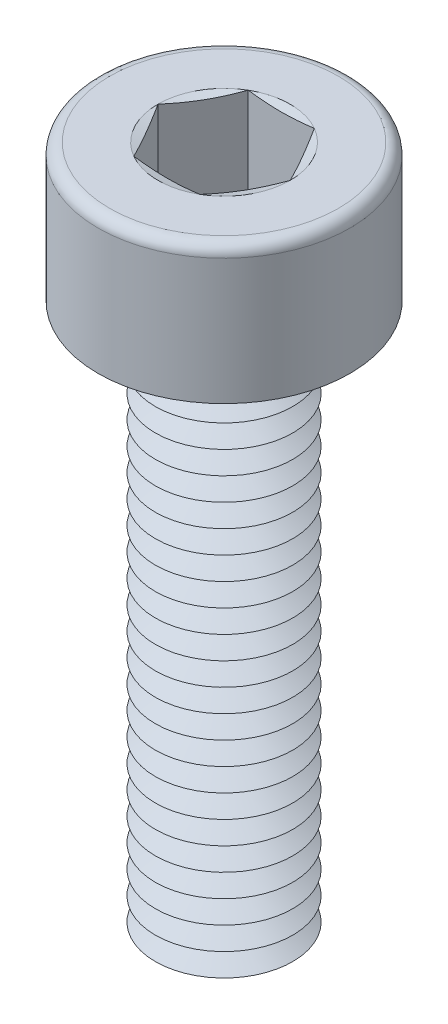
ISO-10303-21;
HEADER;
FILE_DESCRIPTION(('STEP AP214'),'2;1');
FILE_NAME('part.step','',(''),(''),'','','');
FILE_SCHEMA(('AUTOMOTIVE_DESIGN { 1 0 10303 214 1 1 1 1 }'));
ENDSEC;
DATA;
#1=APPLICATION_CONTEXT('core data for automotive mechanical design processes');
#2=APPLICATION_PROTOCOL_DEFINITION('international standard','automotive_design',2000,#1);
#3=PRODUCT_CONTEXT('',#1,'mechanical');
#4=PRODUCT('Part','Part','',(#3));
#5=PRODUCT_RELATED_PRODUCT_CATEGORY('part','',(#4));
#6=PRODUCT_DEFINITION_FORMATION('','',#4);
#7=PRODUCT_DEFINITION_CONTEXT('part definition',#1,'design');
#8=PRODUCT_DEFINITION('design','',#6,#7);
#9=PRODUCT_DEFINITION_SHAPE('','',#8);
#10=(LENGTH_UNIT() NAMED_UNIT(*) SI_UNIT(.MILLI.,.METRE.));
#11=(NAMED_UNIT(*) PLANE_ANGLE_UNIT() SI_UNIT($,.RADIAN.));
#12=(NAMED_UNIT(*) SI_UNIT($,.STERADIAN.) SOLID_ANGLE_UNIT());
#13=UNCERTAINTY_MEASURE_WITH_UNIT(LENGTH_MEASURE(1.E-05),#10,'distance_accuracy_value','');
#14=(GEOMETRIC_REPRESENTATION_CONTEXT(3) GLOBAL_UNCERTAINTY_ASSIGNED_CONTEXT((#13)) GLOBAL_UNIT_ASSIGNED_CONTEXT((#10,
#11,#12)) REPRESENTATION_CONTEXT('',''));
#15=CARTESIAN_POINT('',(0.,0.,0.));
#16=DIRECTION('',(0.,0.,1.));
#17=DIRECTION('',(1.,0.,0.));
#18=AXIS2_PLACEMENT_3D('',#15,#16,#17);
#19=CARTESIAN_POINT('',(0.,2.,0.));
#20=DIRECTION('',(0.,1.,0.));
#21=DIRECTION('',(0.,0.,1.));
#22=AXIS2_PLACEMENT_3D('',#19,#20,#21);
#23=CONICAL_SURFACE('',#22,1.06698729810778,1.0471975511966);
#24=CARTESIAN_POINT('',(0.,2.25,0.));
#25=DIRECTION('',(0.,1.,0.));
#26=DIRECTION('',(0.,0.,1.));
#27=AXIS2_PLACEMENT_3D('',#24,#25,#26);
#28=CIRCLE('',#27,1.5);
#29=CARTESIAN_POINT('',(0.,2.25,1.5));
#30=VERTEX_POINT('',#29);
#31=EDGE_CURVE('E502',#30,#30,#28,.T.);
#32=ORIENTED_EDGE('',*,*,#31,.F.);
#33=EDGE_LOOP('',(#32));
#34=FACE_BOUND('',#33,.T.);
#35=CARTESIAN_POINT('',(0.,2.,0.));
#36=DIRECTION('',(0.,1.,0.));
#37=DIRECTION('',(0.,0.,1.));
#38=AXIS2_PLACEMENT_3D('',#35,#36,#37);
#39=CIRCLE('',#38,1.06698729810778);
#40=CARTESIAN_POINT('',(0.,2.,1.06698729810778));
#41=VERTEX_POINT('',#40);
#42=EDGE_CURVE('E506',#41,#41,#39,.T.);
#43=ORIENTED_EDGE('',*,*,#42,.T.);
#44=EDGE_LOOP('',(#43));
#45=FACE_BOUND('',#44,.T.);
#46=ADVANCED_FACE('F41',(#34,#45),#23,.T.);
#47=CARTESIAN_POINT('',(0.,1.75,0.));
#48=DIRECTION('',(0.,-1.,0.));
#49=DIRECTION('',(0.,0.,-1.));
#50=AXIS2_PLACEMENT_3D('',#47,#48,#49);
#51=CONICAL_SURFACE('',#50,1.5,1.0471975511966);
#52=ORIENTED_EDGE('',*,*,#42,.F.);
#53=EDGE_LOOP('',(#52));
#54=FACE_BOUND('',#53,.T.);
#55=CARTESIAN_POINT('',(0.,1.75,0.));
#56=DIRECTION('',(0.,1.,0.));
#57=DIRECTION('',(0.,0.,1.));
#58=AXIS2_PLACEMENT_3D('',#55,#56,#57);
#59=CIRCLE('',#58,1.5);
#60=CARTESIAN_POINT('',(0.,1.75,1.5));
#61=VERTEX_POINT('',#60);
#62=EDGE_CURVE('E510',#61,#61,#59,.T.);
#63=ORIENTED_EDGE('',*,*,#62,.T.);
#64=EDGE_LOOP('',(#63));
#65=FACE_BOUND('',#64,.T.);
#66=ADVANCED_FACE('F251',(#54,#65),#51,.T.);
#67=CARTESIAN_POINT('',(0.,0.,0.));
#68=DIRECTION('',(0.,1.,0.));
#69=DIRECTION('',(0.,0.,1.));
#70=AXIS2_PLACEMENT_3D('',#67,#68,#69);
#71=PLANE('',#70);
#72=CARTESIAN_POINT('',(0.,0.,0.));
#73=DIRECTION('',(0.,1.,0.));
#74=DIRECTION('',(0.,0.,1.));
#75=AXIS2_PLACEMENT_3D('',#72,#73,#74);
#76=CIRCLE('',#75,1.06698729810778);
#77=CARTESIAN_POINT('',(0.,0.,1.06698729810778));
#78=VERTEX_POINT('',#77);
#79=EDGE_CURVE('E538',#78,#78,#76,.T.);
#80=ORIENTED_EDGE('',*,*,#79,.F.);
#81=EDGE_LOOP('',(#80));
#82=FACE_BOUND('',#81,.T.);
#83=ADVANCED_FACE('F248',(#82),#71,.F.);
#84=CARTESIAN_POINT('',(0.,0.,0.));
#85=DIRECTION('',(0.,1.,0.));
#86=DIRECTION('',(0.,0.,1.));
#87=AXIS2_PLACEMENT_3D('',#84,#85,#86);
#88=CONICAL_SURFACE('',#87,1.06698729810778,1.0471975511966);
#89=CARTESIAN_POINT('',(0.,0.25,0.));
#90=DIRECTION('',(0.,1.,0.));
#91=DIRECTION('',(0.,0.,1.));
#92=AXIS2_PLACEMENT_3D('',#89,#90,#91);
#93=CIRCLE('',#92,1.5);
#94=CARTESIAN_POINT('',(0.,0.25,1.5));
#95=VERTEX_POINT('',#94);
#96=EDGE_CURVE('E534',#95,#95,#93,.T.);
#97=ORIENTED_EDGE('',*,*,#96,.F.);
#98=EDGE_LOOP('',(#97));
#99=FACE_BOUND('',#98,.T.);
#100=ORIENTED_EDGE('',*,*,#79,.T.);
#101=EDGE_LOOP('',(#100));
#102=FACE_BOUND('',#101,.T.);
#103=ADVANCED_FACE('F250',(#99,#102),#88,.T.);
#104=CARTESIAN_POINT('',(0.,0.25,0.));
#105=DIRECTION('',(0.,-1.,0.));
#106=DIRECTION('',(0.,0.,-1.));
#107=AXIS2_PLACEMENT_3D('',#104,#105,#106);
#108=CONICAL_SURFACE('',#107,1.5,1.0471975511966);
#109=CARTESIAN_POINT('',(0.,0.5,0.));
#110=DIRECTION('',(0.,1.,0.));
#111=DIRECTION('',(0.,0.,1.));
#112=AXIS2_PLACEMENT_3D('',#109,#110,#111);
#113=CIRCLE('',#112,1.06698729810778);
#114=CARTESIAN_POINT('',(0.,0.5,1.06698729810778));
#115=VERTEX_POINT('',#114);
#116=EDGE_CURVE('E530',#115,#115,#113,.T.);
#117=ORIENTED_EDGE('',*,*,#116,.F.);
#118=EDGE_LOOP('',(#117));
#119=FACE_BOUND('',#118,.T.);
#120=ORIENTED_EDGE('',*,*,#96,.T.);
#121=EDGE_LOOP('',(#120));
#122=FACE_BOUND('',#121,.T.);
#123=ADVANCED_FACE('F291',(#119,#122),#108,.T.);
#124=CARTESIAN_POINT('',(0.,0.5,0.));
#125=DIRECTION('',(0.,1.,0.));
#126=DIRECTION('',(0.,0.,1.));
#127=AXIS2_PLACEMENT_3D('',#124,#125,#126);
#128=CONICAL_SURFACE('',#127,1.06698729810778,1.0471975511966);
#129=CARTESIAN_POINT('',(0.,0.75,0.));
#130=DIRECTION('',(0.,1.,0.));
#131=DIRECTION('',(0.,0.,1.));
#132=AXIS2_PLACEMENT_3D('',#129,#130,#131);
#133=CIRCLE('',#132,1.5);
#134=CARTESIAN_POINT('',(0.,0.75,1.5));
#135=VERTEX_POINT('',#134);
#136=EDGE_CURVE('E526',#135,#135,#133,.T.);
#137=ORIENTED_EDGE('',*,*,#136,.F.);
#138=EDGE_LOOP('',(#137));
#139=FACE_BOUND('',#138,.T.);
#140=ORIENTED_EDGE('',*,*,#116,.T.);
#141=EDGE_LOOP('',(#140));
#142=FACE_BOUND('',#141,.T.);
#143=ADVANCED_FACE('F286',(#139,#142),#128,.T.);
#144=CARTESIAN_POINT('',(0.,0.75,0.));
#145=DIRECTION('',(0.,-1.,0.));
#146=DIRECTION('',(0.,0.,-1.));
#147=AXIS2_PLACEMENT_3D('',#144,#145,#146);
#148=CONICAL_SURFACE('',#147,1.5,1.0471975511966);
#149=CARTESIAN_POINT('',(0.,1.,0.));
#150=DIRECTION('',(0.,1.,0.));
#151=DIRECTION('',(0.,0.,1.));
#152=AXIS2_PLACEMENT_3D('',#149,#150,#151);
#153=CIRCLE('',#152,1.06698729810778);
#154=CARTESIAN_POINT('',(0.,1.,1.06698729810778));
#155=VERTEX_POINT('',#154);
#156=EDGE_CURVE('E522',#155,#155,#153,.T.);
#157=ORIENTED_EDGE('',*,*,#156,.F.);
#158=EDGE_LOOP('',(#157));
#159=FACE_BOUND('',#158,.T.);
#160=ORIENTED_EDGE('',*,*,#136,.T.);
#161=EDGE_LOOP('',(#160));
#162=FACE_BOUND('',#161,.T.);
#163=ADVANCED_FACE('F283',(#159,#162),#148,.T.);
#164=CARTESIAN_POINT('',(0.,1.,0.));
#165=DIRECTION('',(0.,1.,0.));
#166=DIRECTION('',(0.,0.,1.));
#167=AXIS2_PLACEMENT_3D('',#164,#165,#166);
#168=CONICAL_SURFACE('',#167,1.06698729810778,1.0471975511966);
#169=CARTESIAN_POINT('',(0.,1.25,0.));
#170=DIRECTION('',(0.,1.,0.));
#171=DIRECTION('',(0.,0.,1.));
#172=AXIS2_PLACEMENT_3D('',#169,#170,#171);
#173=CIRCLE('',#172,1.5);
#174=CARTESIAN_POINT('',(0.,1.25,1.5));
#175=VERTEX_POINT('',#174);
#176=EDGE_CURVE('E518',#175,#175,#173,.T.);
#177=ORIENTED_EDGE('',*,*,#176,.F.);
#178=EDGE_LOOP('',(#177));
#179=FACE_BOUND('',#178,.T.);
#180=ORIENTED_EDGE('',*,*,#156,.T.);
#181=EDGE_LOOP('',(#180));
#182=FACE_BOUND('',#181,.T.);
#183=ADVANCED_FACE('F277',(#179,#182),#168,.T.);
#184=CARTESIAN_POINT('',(0.,1.25,0.));
#185=DIRECTION('',(0.,-1.,0.));
#186=DIRECTION('',(0.,0.,-1.));
#187=AXIS2_PLACEMENT_3D('',#184,#185,#186);
#188=CONICAL_SURFACE('',#187,1.5,1.0471975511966);
#189=CARTESIAN_POINT('',(0.,1.5,0.));
#190=DIRECTION('',(0.,1.,0.));
#191=DIRECTION('',(0.,0.,1.));
#192=AXIS2_PLACEMENT_3D('',#189,#190,#191);
#193=CIRCLE('',#192,1.06698729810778);
#194=CARTESIAN_POINT('',(0.,1.5,1.06698729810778));
#195=VERTEX_POINT('',#194);
#196=EDGE_CURVE('E514',#195,#195,#193,.T.);
#197=ORIENTED_EDGE('',*,*,#196,.F.);
#198=EDGE_LOOP('',(#197));
#199=FACE_BOUND('',#198,.T.);
#200=ORIENTED_EDGE('',*,*,#176,.T.);
#201=EDGE_LOOP('',(#200));
#202=FACE_BOUND('',#201,.T.);
#203=ADVANCED_FACE('F273',(#199,#202),#188,.T.);
#204=CARTESIAN_POINT('',(0.,1.5,0.));
#205=DIRECTION('',(0.,1.,0.));
#206=DIRECTION('',(0.,0.,1.));
#207=AXIS2_PLACEMENT_3D('',#204,#205,#206);
#208=CONICAL_SURFACE('',#207,1.06698729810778,1.0471975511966);
#209=ORIENTED_EDGE('',*,*,#62,.F.);
#210=EDGE_LOOP('',(#209));
#211=FACE_BOUND('',#210,.T.);
#212=ORIENTED_EDGE('',*,*,#196,.T.);
#213=EDGE_LOOP('',(#212));
#214=FACE_BOUND('',#213,.T.);
#215=ADVANCED_FACE('F276',(#211,#214),#208,.T.);
#216=CARTESIAN_POINT('',(0.,2.5,0.));
#217=DIRECTION('',(0.,1.,0.));
#218=DIRECTION('',(0.,0.,1.));
#219=AXIS2_PLACEMENT_3D('',#216,#217,#218);
#220=CONICAL_SURFACE('',#219,1.06698729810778,1.0471975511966);
#221=CARTESIAN_POINT('',(0.,2.75,0.));
#222=DIRECTION('',(0.,1.,0.));
#223=DIRECTION('',(0.,0.,1.));
#224=AXIS2_PLACEMENT_3D('',#221,#222,#223);
#225=CIRCLE('',#224,1.5);
#226=CARTESIAN_POINT('',(0.,2.75,1.5));
#227=VERTEX_POINT('',#226);
#228=EDGE_CURVE('E494',#227,#227,#225,.T.);
#229=ORIENTED_EDGE('',*,*,#228,.F.);
#230=EDGE_LOOP('',(#229));
#231=FACE_BOUND('',#230,.T.);
#232=CARTESIAN_POINT('',(0.,2.5,0.));
#233=DIRECTION('',(0.,1.,0.));
#234=DIRECTION('',(0.,0.,1.));
#235=AXIS2_PLACEMENT_3D('',#232,#233,#234);
#236=CIRCLE('',#235,1.06698729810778);
#237=CARTESIAN_POINT('',(0.,2.5,1.06698729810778));
#238=VERTEX_POINT('',#237);
#239=EDGE_CURVE('E498',#238,#238,#236,.T.);
#240=ORIENTED_EDGE('',*,*,#239,.T.);
#241=EDGE_LOOP('',(#240));
#242=FACE_BOUND('',#241,.T.);
#243=ADVANCED_FACE('F281',(#231,#242),#220,.T.);
#244=CARTESIAN_POINT('',(0.,2.25,0.));
#245=DIRECTION('',(0.,-1.,0.));
#246=DIRECTION('',(0.,0.,-1.));
#247=AXIS2_PLACEMENT_3D('',#244,#245,#246);
#248=CONICAL_SURFACE('',#247,1.5,1.0471975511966);
#249=ORIENTED_EDGE('',*,*,#239,.F.);
#250=EDGE_LOOP('',(#249));
#251=FACE_BOUND('',#250,.T.);
#252=ORIENTED_EDGE('',*,*,#31,.T.);
#253=EDGE_LOOP('',(#252));
#254=FACE_BOUND('',#253,.T.);
#255=ADVANCED_FACE('F772',(#251,#254),#248,.T.);
#256=CARTESIAN_POINT('',(0.,3.,0.));
#257=DIRECTION('',(0.,1.,0.));
#258=DIRECTION('',(0.,0.,1.));
#259=AXIS2_PLACEMENT_3D('',#256,#257,#258);
#260=CONICAL_SURFACE('',#259,1.06698729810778,1.0471975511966);
#261=CARTESIAN_POINT('',(0.,3.25,0.));
#262=DIRECTION('',(0.,1.,0.));
#263=DIRECTION('',(0.,0.,1.));
#264=AXIS2_PLACEMENT_3D('',#261,#262,#263);
#265=CIRCLE('',#264,1.5);
#266=CARTESIAN_POINT('',(0.,3.25,1.5));
#267=VERTEX_POINT('',#266);
#268=EDGE_CURVE('E486',#267,#267,#265,.T.);
#269=ORIENTED_EDGE('',*,*,#268,.F.);
#270=EDGE_LOOP('',(#269));
#271=FACE_BOUND('',#270,.T.);
#272=CARTESIAN_POINT('',(0.,3.,0.));
#273=DIRECTION('',(0.,1.,0.));
#274=DIRECTION('',(0.,0.,1.));
#275=AXIS2_PLACEMENT_3D('',#272,#273,#274);
#276=CIRCLE('',#275,1.06698729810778);
#277=CARTESIAN_POINT('',(0.,3.,1.06698729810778));
#278=VERTEX_POINT('',#277);
#279=EDGE_CURVE('E490',#278,#278,#276,.T.);
#280=ORIENTED_EDGE('',*,*,#279,.T.);
#281=EDGE_LOOP('',(#280));
#282=FACE_BOUND('',#281,.T.);
#283=ADVANCED_FACE('F781',(#271,#282),#260,.T.);
#284=CARTESIAN_POINT('',(0.,2.75,0.));
#285=DIRECTION('',(0.,-1.,0.));
#286=DIRECTION('',(0.,0.,-1.));
#287=AXIS2_PLACEMENT_3D('',#284,#285,#286);
#288=CONICAL_SURFACE('',#287,1.5,1.0471975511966);
#289=ORIENTED_EDGE('',*,*,#279,.F.);
#290=EDGE_LOOP('',(#289));
#291=FACE_BOUND('',#290,.T.);
#292=ORIENTED_EDGE('',*,*,#228,.T.);
#293=EDGE_LOOP('',(#292));
#294=FACE_BOUND('',#293,.T.);
#295=ADVANCED_FACE('F791',(#291,#294),#288,.T.);
#296=CARTESIAN_POINT('',(0.,3.5,0.));
#297=DIRECTION('',(0.,1.,0.));
#298=DIRECTION('',(0.,0.,1.));
#299=AXIS2_PLACEMENT_3D('',#296,#297,#298);
#300=CONICAL_SURFACE('',#299,1.06698729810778,1.0471975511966);
#301=CARTESIAN_POINT('',(0.,3.75,0.));
#302=DIRECTION('',(0.,1.,0.));
#303=DIRECTION('',(0.,0.,1.));
#304=AXIS2_PLACEMENT_3D('',#301,#302,#303);
#305=CIRCLE('',#304,1.5);
#306=CARTESIAN_POINT('',(0.,3.75,1.5));
#307=VERTEX_POINT('',#306);
#308=EDGE_CURVE('E478',#307,#307,#305,.T.);
#309=ORIENTED_EDGE('',*,*,#308,.F.);
#310=EDGE_LOOP('',(#309));
#311=FACE_BOUND('',#310,.T.);
#312=CARTESIAN_POINT('',(0.,3.5,0.));
#313=DIRECTION('',(0.,1.,0.));
#314=DIRECTION('',(0.,0.,1.));
#315=AXIS2_PLACEMENT_3D('',#312,#313,#314);
#316=CIRCLE('',#315,1.06698729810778);
#317=CARTESIAN_POINT('',(0.,3.5,1.06698729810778));
#318=VERTEX_POINT('',#317);
#319=EDGE_CURVE('E482',#318,#318,#316,.T.);
#320=ORIENTED_EDGE('',*,*,#319,.T.);
#321=EDGE_LOOP('',(#320));
#322=FACE_BOUND('',#321,.T.);
#323=ADVANCED_FACE('F801',(#311,#322),#300,.T.);
#324=CARTESIAN_POINT('',(0.,3.25,0.));
#325=DIRECTION('',(0.,-1.,0.));
#326=DIRECTION('',(0.,0.,-1.));
#327=AXIS2_PLACEMENT_3D('',#324,#325,#326);
#328=CONICAL_SURFACE('',#327,1.5,1.0471975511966);
#329=ORIENTED_EDGE('',*,*,#319,.F.);
#330=EDGE_LOOP('',(#329));
#331=FACE_BOUND('',#330,.T.);
#332=ORIENTED_EDGE('',*,*,#268,.T.);
#333=EDGE_LOOP('',(#332));
#334=FACE_BOUND('',#333,.T.);
#335=ADVANCED_FACE('F811',(#331,#334),#328,.T.);
#336=CARTESIAN_POINT('',(0.,4.,0.));
#337=DIRECTION('',(0.,1.,0.));
#338=DIRECTION('',(0.,0.,1.));
#339=AXIS2_PLACEMENT_3D('',#336,#337,#338);
#340=CONICAL_SURFACE('',#339,1.06698729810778,1.0471975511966);
#341=CARTESIAN_POINT('',(0.,4.25,0.));
#342=DIRECTION('',(0.,1.,0.));
#343=DIRECTION('',(0.,0.,1.));
#344=AXIS2_PLACEMENT_3D('',#341,#342,#343);
#345=CIRCLE('',#344,1.5);
#346=CARTESIAN_POINT('',(0.,4.25,1.5));
#347=VERTEX_POINT('',#346);
#348=EDGE_CURVE('E471',#347,#347,#345,.T.);
#349=ORIENTED_EDGE('',*,*,#348,.F.);
#350=EDGE_LOOP('',(#349));
#351=FACE_BOUND('',#350,.T.);
#352=CARTESIAN_POINT('',(0.,4.,0.));
#353=DIRECTION('',(0.,1.,0.));
#354=DIRECTION('',(0.,0.,1.));
#355=AXIS2_PLACEMENT_3D('',#352,#353,#354);
#356=CIRCLE('',#355,1.06698729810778);
#357=CARTESIAN_POINT('',(0.,4.,1.06698729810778));
#358=VERTEX_POINT('',#357);
#359=EDGE_CURVE('E474',#358,#358,#356,.T.);
#360=ORIENTED_EDGE('',*,*,#359,.T.);
#361=EDGE_LOOP('',(#360));
#362=FACE_BOUND('',#361,.T.);
#363=ADVANCED_FACE('F821',(#351,#362),#340,.T.);
#364=CARTESIAN_POINT('',(0.,3.75,0.));
#365=DIRECTION('',(0.,-1.,0.));
#366=DIRECTION('',(0.,0.,-1.));
#367=AXIS2_PLACEMENT_3D('',#364,#365,#366);
#368=CONICAL_SURFACE('',#367,1.5,1.0471975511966);
#369=ORIENTED_EDGE('',*,*,#359,.F.);
#370=EDGE_LOOP('',(#369));
#371=FACE_BOUND('',#370,.T.);
#372=ORIENTED_EDGE('',*,*,#308,.T.);
#373=EDGE_LOOP('',(#372));
#374=FACE_BOUND('',#373,.T.);
#375=ADVANCED_FACE('F831',(#371,#374),#368,.T.);
#376=CARTESIAN_POINT('',(0.,4.5,0.));
#377=DIRECTION('',(0.,1.,0.));
#378=DIRECTION('',(0.,0.,1.));
#379=AXIS2_PLACEMENT_3D('',#376,#377,#378);
#380=CONICAL_SURFACE('',#379,1.06698729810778,1.0471975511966);
#381=CARTESIAN_POINT('',(0.,4.75,0.));
#382=DIRECTION('',(0.,1.,0.));
#383=DIRECTION('',(0.,0.,1.));
#384=AXIS2_PLACEMENT_3D('',#381,#382,#383);
#385=CIRCLE('',#384,1.5);
#386=CARTESIAN_POINT('',(0.,4.75,1.5));
#387=VERTEX_POINT('',#386);
#388=EDGE_CURVE('E463',#387,#387,#385,.T.);
#389=ORIENTED_EDGE('',*,*,#388,.F.);
#390=EDGE_LOOP('',(#389));
#391=FACE_BOUND('',#390,.T.);
#392=CARTESIAN_POINT('',(0.,4.5,0.));
#393=DIRECTION('',(0.,1.,0.));
#394=DIRECTION('',(0.,0.,1.));
#395=AXIS2_PLACEMENT_3D('',#392,#393,#394);
#396=CIRCLE('',#395,1.06698729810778);
#397=CARTESIAN_POINT('',(0.,4.5,1.06698729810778));
#398=VERTEX_POINT('',#397);
#399=EDGE_CURVE('E467',#398,#398,#396,.T.);
#400=ORIENTED_EDGE('',*,*,#399,.T.);
#401=EDGE_LOOP('',(#400));
#402=FACE_BOUND('',#401,.T.);
#403=ADVANCED_FACE('F841',(#391,#402),#380,.T.);
#404=CARTESIAN_POINT('',(0.,4.25,0.));
#405=DIRECTION('',(0.,-1.,0.));
#406=DIRECTION('',(0.,0.,-1.));
#407=AXIS2_PLACEMENT_3D('',#404,#405,#406);
#408=CONICAL_SURFACE('',#407,1.5,1.0471975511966);
#409=ORIENTED_EDGE('',*,*,#399,.F.);
#410=EDGE_LOOP('',(#409));
#411=FACE_BOUND('',#410,.T.);
#412=ORIENTED_EDGE('',*,*,#348,.T.);
#413=EDGE_LOOP('',(#412));
#414=FACE_BOUND('',#413,.T.);
#415=ADVANCED_FACE('F851',(#411,#414),#408,.T.);
#416=CARTESIAN_POINT('',(0.,5.,0.));
#417=DIRECTION('',(0.,1.,0.));
#418=DIRECTION('',(0.,0.,1.));
#419=AXIS2_PLACEMENT_3D('',#416,#417,#418);
#420=CONICAL_SURFACE('',#419,1.06698729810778,1.0471975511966);
#421=CARTESIAN_POINT('',(0.,5.25,0.));
#422=DIRECTION('',(0.,1.,0.));
#423=DIRECTION('',(0.,0.,1.));
#424=AXIS2_PLACEMENT_3D('',#421,#422,#423);
#425=CIRCLE('',#424,1.5);
#426=CARTESIAN_POINT('',(0.,5.25,1.5));
#427=VERTEX_POINT('',#426);
#428=EDGE_CURVE('E455',#427,#427,#425,.T.);
#429=ORIENTED_EDGE('',*,*,#428,.F.);
#430=EDGE_LOOP('',(#429));
#431=FACE_BOUND('',#430,.T.);
#432=CARTESIAN_POINT('',(0.,5.,0.));
#433=DIRECTION('',(0.,1.,0.));
#434=DIRECTION('',(0.,0.,1.));
#435=AXIS2_PLACEMENT_3D('',#432,#433,#434);
#436=CIRCLE('',#435,1.06698729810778);
#437=CARTESIAN_POINT('',(0.,5.,1.06698729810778));
#438=VERTEX_POINT('',#437);
#439=EDGE_CURVE('E459',#438,#438,#436,.T.);
#440=ORIENTED_EDGE('',*,*,#439,.T.);
#441=EDGE_LOOP('',(#440));
#442=FACE_BOUND('',#441,.T.);
#443=ADVANCED_FACE('F861',(#431,#442),#420,.T.);
#444=CARTESIAN_POINT('',(0.,4.75,0.));
#445=DIRECTION('',(0.,-1.,0.));
#446=DIRECTION('',(0.,0.,-1.));
#447=AXIS2_PLACEMENT_3D('',#444,#445,#446);
#448=CONICAL_SURFACE('',#447,1.5,1.0471975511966);
#449=ORIENTED_EDGE('',*,*,#439,.F.);
#450=EDGE_LOOP('',(#449));
#451=FACE_BOUND('',#450,.T.);
#452=ORIENTED_EDGE('',*,*,#388,.T.);
#453=EDGE_LOOP('',(#452));
#454=FACE_BOUND('',#453,.T.);
#455=ADVANCED_FACE('F871',(#451,#454),#448,.T.);
#456=CARTESIAN_POINT('',(0.,5.5,0.));
#457=DIRECTION('',(0.,1.,0.));
#458=DIRECTION('',(0.,0.,1.));
#459=AXIS2_PLACEMENT_3D('',#456,#457,#458);
#460=CONICAL_SURFACE('',#459,1.06698729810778,1.0471975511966);
#461=CARTESIAN_POINT('',(0.,5.75,0.));
#462=DIRECTION('',(0.,1.,0.));
#463=DIRECTION('',(0.,0.,1.));
#464=AXIS2_PLACEMENT_3D('',#461,#462,#463);
#465=CIRCLE('',#464,1.5);
#466=CARTESIAN_POINT('',(0.,5.75,1.5));
#467=VERTEX_POINT('',#466);
#468=EDGE_CURVE('E447',#467,#467,#465,.T.);
#469=ORIENTED_EDGE('',*,*,#468,.F.);
#470=EDGE_LOOP('',(#469));
#471=FACE_BOUND('',#470,.T.);
#472=CARTESIAN_POINT('',(0.,5.5,0.));
#473=DIRECTION('',(0.,1.,0.));
#474=DIRECTION('',(0.,0.,1.));
#475=AXIS2_PLACEMENT_3D('',#472,#473,#474);
#476=CIRCLE('',#475,1.06698729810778);
#477=CARTESIAN_POINT('',(0.,5.5,1.06698729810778));
#478=VERTEX_POINT('',#477);
#479=EDGE_CURVE('E451',#478,#478,#476,.T.);
#480=ORIENTED_EDGE('',*,*,#479,.T.);
#481=EDGE_LOOP('',(#480));
#482=FACE_BOUND('',#481,.T.);
#483=ADVANCED_FACE('F881',(#471,#482),#460,.T.);
#484=CARTESIAN_POINT('',(0.,5.25,0.));
#485=DIRECTION('',(0.,-1.,0.));
#486=DIRECTION('',(0.,0.,-1.));
#487=AXIS2_PLACEMENT_3D('',#484,#485,#486);
#488=CONICAL_SURFACE('',#487,1.5,1.0471975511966);
#489=ORIENTED_EDGE('',*,*,#479,.F.);
#490=EDGE_LOOP('',(#489));
#491=FACE_BOUND('',#490,.T.);
#492=ORIENTED_EDGE('',*,*,#428,.T.);
#493=EDGE_LOOP('',(#492));
#494=FACE_BOUND('',#493,.T.);
#495=ADVANCED_FACE('F891',(#491,#494),#488,.T.);
#496=CARTESIAN_POINT('',(0.,6.,0.));
#497=DIRECTION('',(0.,1.,0.));
#498=DIRECTION('',(0.,0.,1.));
#499=AXIS2_PLACEMENT_3D('',#496,#497,#498);
#500=CONICAL_SURFACE('',#499,1.06698729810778,1.0471975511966);
#501=CARTESIAN_POINT('',(0.,6.25,0.));
#502=DIRECTION('',(0.,1.,0.));
#503=DIRECTION('',(0.,0.,1.));
#504=AXIS2_PLACEMENT_3D('',#501,#502,#503);
#505=CIRCLE('',#504,1.5);
#506=CARTESIAN_POINT('',(0.,6.25,1.5));
#507=VERTEX_POINT('',#506);
#508=EDGE_CURVE('E439',#507,#507,#505,.T.);
#509=ORIENTED_EDGE('',*,*,#508,.F.);
#510=EDGE_LOOP('',(#509));
#511=FACE_BOUND('',#510,.T.);
#512=CARTESIAN_POINT('',(0.,6.,0.));
#513=DIRECTION('',(0.,1.,0.));
#514=DIRECTION('',(0.,0.,1.));
#515=AXIS2_PLACEMENT_3D('',#512,#513,#514);
#516=CIRCLE('',#515,1.06698729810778);
#517=CARTESIAN_POINT('',(0.,6.,1.06698729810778));
#518=VERTEX_POINT('',#517);
#519=EDGE_CURVE('E443',#518,#518,#516,.T.);
#520=ORIENTED_EDGE('',*,*,#519,.T.);
#521=EDGE_LOOP('',(#520));
#522=FACE_BOUND('',#521,.T.);
#523=ADVANCED_FACE('F901',(#511,#522),#500,.T.);
#524=CARTESIAN_POINT('',(0.,5.75,0.));
#525=DIRECTION('',(0.,-1.,0.));
#526=DIRECTION('',(0.,0.,-1.));
#527=AXIS2_PLACEMENT_3D('',#524,#525,#526);
#528=CONICAL_SURFACE('',#527,1.5,1.0471975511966);
#529=ORIENTED_EDGE('',*,*,#519,.F.);
#530=EDGE_LOOP('',(#529));
#531=FACE_BOUND('',#530,.T.);
#532=ORIENTED_EDGE('',*,*,#468,.T.);
#533=EDGE_LOOP('',(#532));
#534=FACE_BOUND('',#533,.T.);
#535=ADVANCED_FACE('F911',(#531,#534),#528,.T.);
#536=CARTESIAN_POINT('',(0.,6.5,0.));
#537=DIRECTION('',(0.,1.,0.));
#538=DIRECTION('',(0.,0.,1.));
#539=AXIS2_PLACEMENT_3D('',#536,#537,#538);
#540=CONICAL_SURFACE('',#539,1.06698729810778,1.0471975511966);
#541=CARTESIAN_POINT('',(0.,6.75,0.));
#542=DIRECTION('',(0.,1.,0.));
#543=DIRECTION('',(0.,0.,1.));
#544=AXIS2_PLACEMENT_3D('',#541,#542,#543);
#545=CIRCLE('',#544,1.5);
#546=CARTESIAN_POINT('',(0.,6.75,1.5));
#547=VERTEX_POINT('',#546);
#548=EDGE_CURVE('E431',#547,#547,#545,.T.);
#549=ORIENTED_EDGE('',*,*,#548,.F.);
#550=EDGE_LOOP('',(#549));
#551=FACE_BOUND('',#550,.T.);
#552=CARTESIAN_POINT('',(0.,6.5,0.));
#553=DIRECTION('',(0.,1.,0.));
#554=DIRECTION('',(0.,0.,1.));
#555=AXIS2_PLACEMENT_3D('',#552,#553,#554);
#556=CIRCLE('',#555,1.06698729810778);
#557=CARTESIAN_POINT('',(0.,6.5,1.06698729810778));
#558=VERTEX_POINT('',#557);
#559=EDGE_CURVE('E435',#558,#558,#556,.T.);
#560=ORIENTED_EDGE('',*,*,#559,.T.);
#561=EDGE_LOOP('',(#560));
#562=FACE_BOUND('',#561,.T.);
#563=ADVANCED_FACE('F921',(#551,#562),#540,.T.);
#564=CARTESIAN_POINT('',(0.,6.25,0.));
#565=DIRECTION('',(0.,-1.,0.));
#566=DIRECTION('',(0.,0.,-1.));
#567=AXIS2_PLACEMENT_3D('',#564,#565,#566);
#568=CONICAL_SURFACE('',#567,1.5,1.0471975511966);
#569=ORIENTED_EDGE('',*,*,#559,.F.);
#570=EDGE_LOOP('',(#569));
#571=FACE_BOUND('',#570,.T.);
#572=ORIENTED_EDGE('',*,*,#508,.T.);
#573=EDGE_LOOP('',(#572));
#574=FACE_BOUND('',#573,.T.);
#575=ADVANCED_FACE('F931',(#571,#574),#568,.T.);
#576=CARTESIAN_POINT('',(0.,7.,0.));
#577=DIRECTION('',(0.,1.,0.));
#578=DIRECTION('',(0.,0.,1.));
#579=AXIS2_PLACEMENT_3D('',#576,#577,#578);
#580=CONICAL_SURFACE('',#579,1.06698729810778,1.0471975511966);
#581=CARTESIAN_POINT('',(0.,7.25,0.));
#582=DIRECTION('',(0.,1.,0.));
#583=DIRECTION('',(0.,0.,1.));
#584=AXIS2_PLACEMENT_3D('',#581,#582,#583);
#585=CIRCLE('',#584,1.5);
#586=CARTESIAN_POINT('',(0.,7.25,1.5));
#587=VERTEX_POINT('',#586);
#588=EDGE_CURVE('E423',#587,#587,#585,.T.);
#589=ORIENTED_EDGE('',*,*,#588,.F.);
#590=EDGE_LOOP('',(#589));
#591=FACE_BOUND('',#590,.T.);
#592=CARTESIAN_POINT('',(0.,7.,0.));
#593=DIRECTION('',(0.,1.,0.));
#594=DIRECTION('',(0.,0.,1.));
#595=AXIS2_PLACEMENT_3D('',#592,#593,#594);
#596=CIRCLE('',#595,1.06698729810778);
#597=CARTESIAN_POINT('',(0.,7.,1.06698729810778));
#598=VERTEX_POINT('',#597);
#599=EDGE_CURVE('E427',#598,#598,#596,.T.);
#600=ORIENTED_EDGE('',*,*,#599,.T.);
#601=EDGE_LOOP('',(#600));
#602=FACE_BOUND('',#601,.T.);
#603=ADVANCED_FACE('F941',(#591,#602),#580,.T.);
#604=CARTESIAN_POINT('',(0.,6.75,0.));
#605=DIRECTION('',(0.,-1.,0.));
#606=DIRECTION('',(0.,0.,-1.));
#607=AXIS2_PLACEMENT_3D('',#604,#605,#606);
#608=CONICAL_SURFACE('',#607,1.5,1.0471975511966);
#609=ORIENTED_EDGE('',*,*,#599,.F.);
#610=EDGE_LOOP('',(#609));
#611=FACE_BOUND('',#610,.T.);
#612=ORIENTED_EDGE('',*,*,#548,.T.);
#613=EDGE_LOOP('',(#612));
#614=FACE_BOUND('',#613,.T.);
#615=ADVANCED_FACE('F951',(#611,#614),#608,.T.);
#616=CARTESIAN_POINT('',(0.,7.5,0.));
#617=DIRECTION('',(0.,1.,0.));
#618=DIRECTION('',(0.,0.,1.));
#619=AXIS2_PLACEMENT_3D('',#616,#617,#618);
#620=CONICAL_SURFACE('',#619,1.06698729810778,1.0471975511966);
#621=CARTESIAN_POINT('',(0.,7.75,0.));
#622=DIRECTION('',(0.,1.,0.));
#623=DIRECTION('',(0.,0.,1.));
#624=AXIS2_PLACEMENT_3D('',#621,#622,#623);
#625=CIRCLE('',#624,1.5);
#626=CARTESIAN_POINT('',(0.,7.75,1.5));
#627=VERTEX_POINT('',#626);
#628=EDGE_CURVE('E415',#627,#627,#625,.T.);
#629=ORIENTED_EDGE('',*,*,#628,.F.);
#630=EDGE_LOOP('',(#629));
#631=FACE_BOUND('',#630,.T.);
#632=CARTESIAN_POINT('',(0.,7.5,0.));
#633=DIRECTION('',(0.,1.,0.));
#634=DIRECTION('',(0.,0.,1.));
#635=AXIS2_PLACEMENT_3D('',#632,#633,#634);
#636=CIRCLE('',#635,1.06698729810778);
#637=CARTESIAN_POINT('',(0.,7.5,1.06698729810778));
#638=VERTEX_POINT('',#637);
#639=EDGE_CURVE('E419',#638,#638,#636,.T.);
#640=ORIENTED_EDGE('',*,*,#639,.T.);
#641=EDGE_LOOP('',(#640));
#642=FACE_BOUND('',#641,.T.);
#643=ADVANCED_FACE('F961',(#631,#642),#620,.T.);
#644=CARTESIAN_POINT('',(0.,7.25,0.));
#645=DIRECTION('',(0.,-1.,0.));
#646=DIRECTION('',(0.,0.,-1.));
#647=AXIS2_PLACEMENT_3D('',#644,#645,#646);
#648=CONICAL_SURFACE('',#647,1.5,1.0471975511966);
#649=ORIENTED_EDGE('',*,*,#639,.F.);
#650=EDGE_LOOP('',(#649));
#651=FACE_BOUND('',#650,.T.);
#652=ORIENTED_EDGE('',*,*,#588,.T.);
#653=EDGE_LOOP('',(#652));
#654=FACE_BOUND('',#653,.T.);
#655=ADVANCED_FACE('F971',(#651,#654),#648,.T.);
#656=CARTESIAN_POINT('',(0.,8.,0.));
#657=DIRECTION('',(0.,1.,0.));
#658=DIRECTION('',(0.,0.,1.));
#659=AXIS2_PLACEMENT_3D('',#656,#657,#658);
#660=CONICAL_SURFACE('',#659,1.06698729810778,1.0471975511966);
#661=CARTESIAN_POINT('',(0.,8.25,0.));
#662=DIRECTION('',(0.,1.,0.));
#663=DIRECTION('',(0.,0.,1.));
#664=AXIS2_PLACEMENT_3D('',#661,#662,#663);
#665=CIRCLE('',#664,1.5);
#666=CARTESIAN_POINT('',(0.,8.25,1.5));
#667=VERTEX_POINT('',#666);
#668=EDGE_CURVE('E407',#667,#667,#665,.T.);
#669=ORIENTED_EDGE('',*,*,#668,.F.);
#670=EDGE_LOOP('',(#669));
#671=FACE_BOUND('',#670,.T.);
#672=CARTESIAN_POINT('',(0.,8.,0.));
#673=DIRECTION('',(0.,1.,0.));
#674=DIRECTION('',(0.,0.,1.));
#675=AXIS2_PLACEMENT_3D('',#672,#673,#674);
#676=CIRCLE('',#675,1.06698729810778);
#677=CARTESIAN_POINT('',(0.,8.,1.06698729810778));
#678=VERTEX_POINT('',#677);
#679=EDGE_CURVE('E411',#678,#678,#676,.T.);
#680=ORIENTED_EDGE('',*,*,#679,.T.);
#681=EDGE_LOOP('',(#680));
#682=FACE_BOUND('',#681,.T.);
#683=ADVANCED_FACE('F981',(#671,#682),#660,.T.);
#684=CARTESIAN_POINT('',(0.,7.75,0.));
#685=DIRECTION('',(0.,-1.,0.));
#686=DIRECTION('',(0.,0.,-1.));
#687=AXIS2_PLACEMENT_3D('',#684,#685,#686);
#688=CONICAL_SURFACE('',#687,1.5,1.0471975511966);
#689=ORIENTED_EDGE('',*,*,#679,.F.);
#690=EDGE_LOOP('',(#689));
#691=FACE_BOUND('',#690,.T.);
#692=ORIENTED_EDGE('',*,*,#628,.T.);
#693=EDGE_LOOP('',(#692));
#694=FACE_BOUND('',#693,.T.);
#695=ADVANCED_FACE('F991',(#691,#694),#688,.T.);
#696=CARTESIAN_POINT('',(0.,8.5,0.));
#697=DIRECTION('',(0.,1.,0.));
#698=DIRECTION('',(0.,0.,1.));
#699=AXIS2_PLACEMENT_3D('',#696,#697,#698);
#700=CONICAL_SURFACE('',#699,1.06698729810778,1.0471975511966);
#701=CARTESIAN_POINT('',(0.,8.75,0.));
#702=DIRECTION('',(0.,1.,0.));
#703=DIRECTION('',(0.,0.,1.));
#704=AXIS2_PLACEMENT_3D('',#701,#702,#703);
#705=CIRCLE('',#704,1.5);
#706=CARTESIAN_POINT('',(0.,8.75,1.5));
#707=VERTEX_POINT('',#706);
#708=EDGE_CURVE('E399',#707,#707,#705,.T.);
#709=ORIENTED_EDGE('',*,*,#708,.F.);
#710=EDGE_LOOP('',(#709));
#711=FACE_BOUND('',#710,.T.);
#712=CARTESIAN_POINT('',(0.,8.5,0.));
#713=DIRECTION('',(0.,1.,0.));
#714=DIRECTION('',(0.,0.,1.));
#715=AXIS2_PLACEMENT_3D('',#712,#713,#714);
#716=CIRCLE('',#715,1.06698729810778);
#717=CARTESIAN_POINT('',(0.,8.5,1.06698729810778));
#718=VERTEX_POINT('',#717);
#719=EDGE_CURVE('E403',#718,#718,#716,.T.);
#720=ORIENTED_EDGE('',*,*,#719,.T.);
#721=EDGE_LOOP('',(#720));
#722=FACE_BOUND('',#721,.T.);
#723=ADVANCED_FACE('F1001',(#711,#722),#700,.T.);
#724=CARTESIAN_POINT('',(0.,8.25,0.));
#725=DIRECTION('',(0.,-1.,0.));
#726=DIRECTION('',(0.,0.,-1.));
#727=AXIS2_PLACEMENT_3D('',#724,#725,#726);
#728=CONICAL_SURFACE('',#727,1.5,1.0471975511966);
#729=ORIENTED_EDGE('',*,*,#719,.F.);
#730=EDGE_LOOP('',(#729));
#731=FACE_BOUND('',#730,.T.);
#732=ORIENTED_EDGE('',*,*,#668,.T.);
#733=EDGE_LOOP('',(#732));
#734=FACE_BOUND('',#733,.T.);
#735=ADVANCED_FACE('F1011',(#731,#734),#728,.T.);
#736=CARTESIAN_POINT('',(0.,9.,0.));
#737=DIRECTION('',(0.,1.,0.));
#738=DIRECTION('',(0.,0.,1.));
#739=AXIS2_PLACEMENT_3D('',#736,#737,#738);
#740=CONICAL_SURFACE('',#739,1.06698729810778,1.0471975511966);
#741=CARTESIAN_POINT('',(0.,9.25,0.));
#742=DIRECTION('',(0.,1.,0.));
#743=DIRECTION('',(0.,0.,1.));
#744=AXIS2_PLACEMENT_3D('',#741,#742,#743);
#745=CIRCLE('',#744,1.5);
#746=CARTESIAN_POINT('',(0.,9.25,1.5));
#747=VERTEX_POINT('',#746);
#748=EDGE_CURVE('E391',#747,#747,#745,.T.);
#749=ORIENTED_EDGE('',*,*,#748,.F.);
#750=EDGE_LOOP('',(#749));
#751=FACE_BOUND('',#750,.T.);
#752=CARTESIAN_POINT('',(0.,9.,0.));
#753=DIRECTION('',(0.,1.,0.));
#754=DIRECTION('',(0.,0.,1.));
#755=AXIS2_PLACEMENT_3D('',#752,#753,#754);
#756=CIRCLE('',#755,1.06698729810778);
#757=CARTESIAN_POINT('',(0.,9.,1.06698729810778));
#758=VERTEX_POINT('',#757);
#759=EDGE_CURVE('E395',#758,#758,#756,.T.);
#760=ORIENTED_EDGE('',*,*,#759,.T.);
#761=EDGE_LOOP('',(#760));
#762=FACE_BOUND('',#761,.T.);
#763=ADVANCED_FACE('F1021',(#751,#762),#740,.T.);
#764=CARTESIAN_POINT('',(0.,8.75,0.));
#765=DIRECTION('',(0.,-1.,0.));
#766=DIRECTION('',(0.,0.,-1.));
#767=AXIS2_PLACEMENT_3D('',#764,#765,#766);
#768=CONICAL_SURFACE('',#767,1.5,1.0471975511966);
#769=ORIENTED_EDGE('',*,*,#759,.F.);
#770=EDGE_LOOP('',(#769));
#771=FACE_BOUND('',#770,.T.);
#772=ORIENTED_EDGE('',*,*,#708,.T.);
#773=EDGE_LOOP('',(#772));
#774=FACE_BOUND('',#773,.T.);
#775=ADVANCED_FACE('F1031',(#771,#774),#768,.T.);
#776=CARTESIAN_POINT('',(0.,9.5,0.));
#777=DIRECTION('',(0.,1.,0.));
#778=DIRECTION('',(0.,0.,1.));
#779=AXIS2_PLACEMENT_3D('',#776,#777,#778);
#780=CONICAL_SURFACE('',#779,1.06698729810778,1.0471975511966);
#781=CARTESIAN_POINT('',(0.,9.75,0.));
#782=DIRECTION('',(0.,1.,0.));
#783=DIRECTION('',(0.,0.,1.));
#784=AXIS2_PLACEMENT_3D('',#781,#782,#783);
#785=CIRCLE('',#784,1.5);
#786=CARTESIAN_POINT('',(0.,9.75,1.5));
#787=VERTEX_POINT('',#786);
#788=EDGE_CURVE('E383',#787,#787,#785,.T.);
#789=ORIENTED_EDGE('',*,*,#788,.F.);
#790=EDGE_LOOP('',(#789));
#791=FACE_BOUND('',#790,.T.);
#792=CARTESIAN_POINT('',(0.,9.5,0.));
#793=DIRECTION('',(0.,1.,0.));
#794=DIRECTION('',(0.,0.,1.));
#795=AXIS2_PLACEMENT_3D('',#792,#793,#794);
#796=CIRCLE('',#795,1.06698729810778);
#797=CARTESIAN_POINT('',(0.,9.5,1.06698729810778));
#798=VERTEX_POINT('',#797);
#799=EDGE_CURVE('E387',#798,#798,#796,.T.);
#800=ORIENTED_EDGE('',*,*,#799,.T.);
#801=EDGE_LOOP('',(#800));
#802=FACE_BOUND('',#801,.T.);
#803=ADVANCED_FACE('F1041',(#791,#802),#780,.T.);
#804=CARTESIAN_POINT('',(0.,9.25,0.));
#805=DIRECTION('',(0.,-1.,0.));
#806=DIRECTION('',(0.,0.,-1.));
#807=AXIS2_PLACEMENT_3D('',#804,#805,#806);
#808=CONICAL_SURFACE('',#807,1.5,1.0471975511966);
#809=ORIENTED_EDGE('',*,*,#799,.F.);
#810=EDGE_LOOP('',(#809));
#811=FACE_BOUND('',#810,.T.);
#812=ORIENTED_EDGE('',*,*,#748,.T.);
#813=EDGE_LOOP('',(#812));
#814=FACE_BOUND('',#813,.T.);
#815=ADVANCED_FACE('F1051',(#811,#814),#808,.T.);
#816=CARTESIAN_POINT('',(0.,10.,0.));
#817=DIRECTION('',(0.,1.,0.));
#818=DIRECTION('',(0.,0.,1.));
#819=AXIS2_PLACEMENT_3D('',#816,#817,#818);
#820=CONICAL_SURFACE('',#819,1.06698729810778,1.0471975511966);
#821=CARTESIAN_POINT('',(0.,10.25,0.));
#822=DIRECTION('',(0.,1.,0.));
#823=DIRECTION('',(0.,0.,1.));
#824=AXIS2_PLACEMENT_3D('',#821,#822,#823);
#825=CIRCLE('',#824,1.5);
#826=CARTESIAN_POINT('',(0.,10.25,1.5));
#827=VERTEX_POINT('',#826);
#828=EDGE_CURVE('E376',#827,#827,#825,.T.);
#829=ORIENTED_EDGE('',*,*,#828,.F.);
#830=EDGE_LOOP('',(#829));
#831=FACE_BOUND('',#830,.T.);
#832=CARTESIAN_POINT('',(0.,10.,0.));
#833=DIRECTION('',(0.,1.,0.));
#834=DIRECTION('',(0.,0.,1.));
#835=AXIS2_PLACEMENT_3D('',#832,#833,#834);
#836=CIRCLE('',#835,1.06698729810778);
#837=CARTESIAN_POINT('',(0.,10.,1.06698729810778));
#838=VERTEX_POINT('',#837);
#839=EDGE_CURVE('E380',#838,#838,#836,.T.);
#840=ORIENTED_EDGE('',*,*,#839,.T.);
#841=EDGE_LOOP('',(#840));
#842=FACE_BOUND('',#841,.T.);
#843=ADVANCED_FACE('F1061',(#831,#842),#820,.T.);
#844=CARTESIAN_POINT('',(0.,9.75,0.));
#845=DIRECTION('',(0.,-1.,0.));
#846=DIRECTION('',(0.,0.,-1.));
#847=AXIS2_PLACEMENT_3D('',#844,#845,#846);
#848=CONICAL_SURFACE('',#847,1.5,1.0471975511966);
#849=ORIENTED_EDGE('',*,*,#839,.F.);
#850=EDGE_LOOP('',(#849));
#851=FACE_BOUND('',#850,.T.);
#852=ORIENTED_EDGE('',*,*,#788,.T.);
#853=EDGE_LOOP('',(#852));
#854=FACE_BOUND('',#853,.T.);
#855=ADVANCED_FACE('F1071',(#851,#854),#848,.T.);
#856=CARTESIAN_POINT('',(0.,10.5,0.));
#857=DIRECTION('',(0.,1.,0.));
#858=DIRECTION('',(0.,0.,1.));
#859=AXIS2_PLACEMENT_3D('',#856,#857,#858);
#860=CONICAL_SURFACE('',#859,1.06698729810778,1.0471975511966);
#861=CARTESIAN_POINT('',(0.,10.75,0.));
#862=DIRECTION('',(0.,1.,0.));
#863=DIRECTION('',(0.,0.,1.));
#864=AXIS2_PLACEMENT_3D('',#861,#862,#863);
#865=CIRCLE('',#864,1.5);
#866=CARTESIAN_POINT('',(0.,10.75,1.5));
#867=VERTEX_POINT('',#866);
#868=EDGE_CURVE('E369',#867,#867,#865,.T.);
#869=ORIENTED_EDGE('',*,*,#868,.F.);
#870=EDGE_LOOP('',(#869));
#871=FACE_BOUND('',#870,.T.);
#872=CARTESIAN_POINT('',(0.,10.5,0.));
#873=DIRECTION('',(0.,1.,0.));
#874=DIRECTION('',(0.,0.,1.));
#875=AXIS2_PLACEMENT_3D('',#872,#873,#874);
#876=CIRCLE('',#875,1.06698729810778);
#877=CARTESIAN_POINT('',(0.,10.5,1.06698729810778));
#878=VERTEX_POINT('',#877);
#879=EDGE_CURVE('E372',#878,#878,#876,.T.);
#880=ORIENTED_EDGE('',*,*,#879,.T.);
#881=EDGE_LOOP('',(#880));
#882=FACE_BOUND('',#881,.T.);
#883=ADVANCED_FACE('F1081',(#871,#882),#860,.T.);
#884=CARTESIAN_POINT('',(0.,10.25,0.));
#885=DIRECTION('',(0.,-1.,0.));
#886=DIRECTION('',(0.,0.,-1.));
#887=AXIS2_PLACEMENT_3D('',#884,#885,#886);
#888=CONICAL_SURFACE('',#887,1.5,1.0471975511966);
#889=ORIENTED_EDGE('',*,*,#879,.F.);
#890=EDGE_LOOP('',(#889));
#891=FACE_BOUND('',#890,.T.);
#892=ORIENTED_EDGE('',*,*,#828,.T.);
#893=EDGE_LOOP('',(#892));
#894=FACE_BOUND('',#893,.T.);
#895=ADVANCED_FACE('F1091',(#891,#894),#888,.T.);
#896=CARTESIAN_POINT('',(0.,11.,0.));
#897=DIRECTION('',(0.,1.,0.));
#898=DIRECTION('',(0.,0.,1.));
#899=AXIS2_PLACEMENT_3D('',#896,#897,#898);
#900=CONICAL_SURFACE('',#899,1.06698729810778,1.0471975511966);
#901=CARTESIAN_POINT('',(0.,11.25,0.));
#902=DIRECTION('',(0.,1.,0.));
#903=DIRECTION('',(0.,0.,1.));
#904=AXIS2_PLACEMENT_3D('',#901,#902,#903);
#905=CIRCLE('',#904,1.5);
#906=CARTESIAN_POINT('',(0.,11.25,1.5));
#907=VERTEX_POINT('',#906);
#908=EDGE_CURVE('E353',#907,#907,#905,.T.);
#909=ORIENTED_EDGE('',*,*,#908,.F.);
#910=EDGE_LOOP('',(#909));
#911=FACE_BOUND('',#910,.T.);
#912=CARTESIAN_POINT('',(0.,11.,0.));
#913=DIRECTION('',(0.,1.,0.));
#914=DIRECTION('',(0.,0.,1.));
#915=AXIS2_PLACEMENT_3D('',#912,#913,#914);
#916=CIRCLE('',#915,1.06698729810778);
#917=CARTESIAN_POINT('',(0.,11.,1.06698729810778));
#918=VERTEX_POINT('',#917);
#919=EDGE_CURVE('E365',#918,#918,#916,.T.);
#920=ORIENTED_EDGE('',*,*,#919,.T.);
#921=EDGE_LOOP('',(#920));
#922=FACE_BOUND('',#921,.T.);
#923=ADVANCED_FACE('F1101',(#911,#922),#900,.T.);
#924=CARTESIAN_POINT('',(0.,10.75,0.));
#925=DIRECTION('',(0.,-1.,0.));
#926=DIRECTION('',(0.,0.,-1.));
#927=AXIS2_PLACEMENT_3D('',#924,#925,#926);
#928=CONICAL_SURFACE('',#927,1.5,1.0471975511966);
#929=ORIENTED_EDGE('',*,*,#919,.F.);
#930=EDGE_LOOP('',(#929));
#931=FACE_BOUND('',#930,.T.);
#932=ORIENTED_EDGE('',*,*,#868,.T.);
#933=EDGE_LOOP('',(#932));
#934=FACE_BOUND('',#933,.T.);
#935=ADVANCED_FACE('F1111',(#931,#934),#928,.T.);
#936=CARTESIAN_POINT('',(0.,11.5,0.));
#937=DIRECTION('',(0.,1.,0.));
#938=DIRECTION('',(0.,0.,1.));
#939=AXIS2_PLACEMENT_3D('',#936,#937,#938);
#940=CONICAL_SURFACE('',#939,1.06698729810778,1.0471975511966);
#941=CARTESIAN_POINT('',(0.,11.75,0.));
#942=DIRECTION('',(0.,1.,0.));
#943=DIRECTION('',(0.,0.,1.));
#944=AXIS2_PLACEMENT_3D('',#941,#942,#943);
#945=CIRCLE('',#944,1.5);
#946=CARTESIAN_POINT('',(0.,11.75,1.5));
#947=VERTEX_POINT('',#946);
#948=EDGE_CURVE('E360',#947,#947,#945,.T.);
#949=ORIENTED_EDGE('',*,*,#948,.F.);
#950=EDGE_LOOP('',(#949));
#951=FACE_BOUND('',#950,.T.);
#952=CARTESIAN_POINT('',(0.,11.5,0.));
#953=DIRECTION('',(0.,1.,0.));
#954=DIRECTION('',(0.,0.,1.));
#955=AXIS2_PLACEMENT_3D('',#952,#953,#954);
#956=CIRCLE('',#955,1.06698729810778);
#957=CARTESIAN_POINT('',(0.,11.5,1.06698729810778));
#958=VERTEX_POINT('',#957);
#959=EDGE_CURVE('E348',#958,#958,#956,.T.);
#960=ORIENTED_EDGE('',*,*,#959,.T.);
#961=EDGE_LOOP('',(#960));
#962=FACE_BOUND('',#961,.T.);
#963=ADVANCED_FACE('F1121',(#951,#962),#940,.T.);
#964=CARTESIAN_POINT('',(0.,11.25,0.));
#965=DIRECTION('',(0.,-1.,0.));
#966=DIRECTION('',(0.,0.,-1.));
#967=AXIS2_PLACEMENT_3D('',#964,#965,#966);
#968=CONICAL_SURFACE('',#967,1.5,1.0471975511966);
#969=ORIENTED_EDGE('',*,*,#959,.F.);
#970=EDGE_LOOP('',(#969));
#971=FACE_BOUND('',#970,.T.);
#972=ORIENTED_EDGE('',*,*,#908,.T.);
#973=EDGE_LOOP('',(#972));
#974=FACE_BOUND('',#973,.T.);
#975=ADVANCED_FACE('F195',(#971,#974),#968,.T.);
#976=CARTESIAN_POINT('',(0.,15.,0.));
#977=DIRECTION('',(0.,1.,0.));
#978=DIRECTION('',(0.,0.,1.));
#979=AXIS2_PLACEMENT_3D('',#976,#977,#978);
#980=PLANE('',#979);
#981=CARTESIAN_POINT('',(0.,15.,0.));
#982=DIRECTION('',(0.,1.,0.));
#983=DIRECTION('',(0.,0.,1.));
#984=AXIS2_PLACEMENT_3D('',#981,#982,#983);
#985=CIRCLE('',#984,1.44337567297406);
#986=CARTESIAN_POINT('',(0.721687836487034,15.,1.25));
#987=VERTEX_POINT('',#986);
#988=CARTESIAN_POINT('',(1.44337567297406,15.,0.));
#989=VERTEX_POINT('',#988);
#990=EDGE_CURVE('E121',#987,#989,#985,.T.);
#991=ORIENTED_EDGE('',*,*,#990,.F.);
#992=CARTESIAN_POINT('',(0.,15.,0.));
#993=DIRECTION('',(0.,1.,0.));
#994=DIRECTION('',(0.,0.,1.));
#995=AXIS2_PLACEMENT_3D('',#992,#993,#994);
#996=CIRCLE('',#995,1.44337567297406);
#997=CARTESIAN_POINT('',(-0.721687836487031,15.,1.25));
#998=VERTEX_POINT('',#997);
#999=EDGE_CURVE('E45',#998,#987,#996,.T.);
#1000=ORIENTED_EDGE('',*,*,#999,.F.);
#1001=CARTESIAN_POINT('',(-1.44337567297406,15.,0.));
#1002=VERTEX_POINT('',#1001);
#1003=EDGE_CURVE('E138',#1002,#998,#996,.T.);
#1004=ORIENTED_EDGE('',*,*,#1003,.F.);
#1005=CARTESIAN_POINT('',(-0.721687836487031,15.,-1.25));
#1006=VERTEX_POINT('',#1005);
#1007=EDGE_CURVE('E612',#1006,#1002,#996,.T.);
#1008=ORIENTED_EDGE('',*,*,#1007,.F.);
#1009=CARTESIAN_POINT('',(0.721687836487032,15.,-1.25));
#1010=VERTEX_POINT('',#1009);
#1011=EDGE_CURVE('E51',#1010,#1006,#996,.T.);
#1012=ORIENTED_EDGE('',*,*,#1011,.F.);
#1013=EDGE_CURVE('E11',#989,#1010,#996,.T.);
#1014=ORIENTED_EDGE('',*,*,#1013,.F.);
#1015=EDGE_LOOP('',(#991,#1000,#1004,#1008,#1012,#1014));
#1016=FACE_BOUND('',#1015,.T.);
#1017=CARTESIAN_POINT('',(0.,15.,0.));
#1018=DIRECTION('',(0.,1.,0.));
#1019=DIRECTION('',(0.,0.,1.));
#1020=AXIS2_PLACEMENT_3D('',#1017,#1018,#1019);
#1021=CIRCLE('',#1020,2.5);
#1022=CARTESIAN_POINT('',(0.,15.,2.5));
#1023=VERTEX_POINT('',#1022);
#1024=EDGE_CURVE('E582',#1023,#1023,#1021,.T.);
#1025=ORIENTED_EDGE('',*,*,#1024,.T.);
#1026=EDGE_LOOP('',(#1025));
#1027=FACE_BOUND('',#1026,.T.);
#1028=ADVANCED_FACE('F140',(#1016,#1027),#980,.T.);
#1029=CARTESIAN_POINT('',(0.,14.75,0.));
#1030=DIRECTION('',(0.,1.,0.));
#1031=DIRECTION('',(0.,0.,1.));
#1032=AXIS2_PLACEMENT_3D('',#1029,#1030,#1031);
#1033=TOROIDAL_SURFACE('',#1032,2.5,0.25);
#1034=CARTESIAN_POINT('',(0.,14.75,0.));
#1035=DIRECTION('',(0.,1.,0.));
#1036=DIRECTION('',(0.,0.,1.));
#1037=AXIS2_PLACEMENT_3D('',#1034,#1035,#1036);
#1038=CIRCLE('',#1037,2.75);
#1039=CARTESIAN_POINT('',(0.,14.75,2.75));
#1040=VERTEX_POINT('',#1039);
#1041=EDGE_CURVE('E586',#1040,#1040,#1038,.F.);
#1042=ORIENTED_EDGE('',*,*,#1041,.F.);
#1043=EDGE_LOOP('',(#1042));
#1044=FACE_BOUND('',#1043,.T.);
#1045=ORIENTED_EDGE('',*,*,#1024,.F.);
#1046=EDGE_LOOP('',(#1045));
#1047=FACE_BOUND('',#1046,.T.);
#1048=ADVANCED_FACE('F43',(#1044,#1047),#1033,.T.);
#1049=CARTESIAN_POINT('',(0.,15.,0.));
#1050=DIRECTION('',(0.,-1.,0.));
#1051=DIRECTION('',(0.,0.,-1.));
#1052=AXIS2_PLACEMENT_3D('',#1049,#1050,#1051);
#1053=CYLINDRICAL_SURFACE('',#1052,2.75);
#1054=ORIENTED_EDGE('',*,*,#1041,.T.);
#1055=EDGE_LOOP('',(#1054));
#1056=FACE_BOUND('',#1055,.T.);
#1057=CARTESIAN_POINT('',(0.,12.,0.));
#1058=DIRECTION('',(0.,1.,0.));
#1059=DIRECTION('',(0.,0.,1.));
#1060=AXIS2_PLACEMENT_3D('',#1057,#1058,#1059);
#1061=CIRCLE('',#1060,2.75);
#1062=CARTESIAN_POINT('',(0.,12.,2.75));
#1063=VERTEX_POINT('',#1062);
#1064=EDGE_CURVE('E569',#1063,#1063,#1061,.T.);
#1065=ORIENTED_EDGE('',*,*,#1064,.T.);
#1066=EDGE_LOOP('',(#1065));
#1067=FACE_BOUND('',#1066,.T.);
#1068=ADVANCED_FACE('F243',(#1056,#1067),#1053,.T.);
#1069=CARTESIAN_POINT('',(0.,12.,0.));
#1070=DIRECTION('',(0.,1.,0.));
#1071=DIRECTION('',(0.,0.,1.));
#1072=AXIS2_PLACEMENT_3D('',#1069,#1070,#1071);
#1073=PLANE('',#1072);
#1074=ORIENTED_EDGE('',*,*,#1064,.F.);
#1075=EDGE_LOOP('',(#1074));
#1076=FACE_BOUND('',#1075,.T.);
#1077=CARTESIAN_POINT('',(0.,12.,0.));
#1078=DIRECTION('',(0.,1.,0.));
#1079=DIRECTION('',(0.,0.,1.));
#1080=AXIS2_PLACEMENT_3D('',#1077,#1078,#1079);
#1081=CIRCLE('',#1080,1.5);
#1082=CARTESIAN_POINT('',(0.,12.,1.5));
#1083=VERTEX_POINT('',#1082);
#1084=EDGE_CURVE('E578',#1083,#1083,#1081,.T.);
#1085=ORIENTED_EDGE('',*,*,#1084,.T.);
#1086=EDGE_LOOP('',(#1085));
#1087=FACE_BOUND('',#1086,.T.);
#1088=ADVANCED_FACE('F239',(#1076,#1087),#1073,.F.);
#1089=CARTESIAN_POINT('',(0.,12.,0.));
#1090=DIRECTION('',(0.,-1.,0.));
#1091=DIRECTION('',(0.,0.,-1.));
#1092=AXIS2_PLACEMENT_3D('',#1089,#1090,#1091);
#1093=CYLINDRICAL_SURFACE('',#1092,1.5);
#1094=ORIENTED_EDGE('',*,*,#948,.T.);
#1095=EDGE_LOOP('',(#1094));
#1096=FACE_BOUND('',#1095,.T.);
#1097=ORIENTED_EDGE('',*,*,#1084,.F.);
#1098=EDGE_LOOP('',(#1097));
#1099=FACE_BOUND('',#1098,.T.);
#1100=ADVANCED_FACE('F242',(#1096,#1099),#1093,.T.);
#1101=CARTESIAN_POINT('',(0.,15.,0.));
#1102=DIRECTION('',(0.,1.,0.));
#1103=DIRECTION('',(0.,0.,1.));
#1104=AXIS2_PLACEMENT_3D('',#1101,#1102,#1103);
#1105=CONICAL_SURFACE('',#1104,1.44337567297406,1.30899693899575);
#1106=ORIENTED_EDGE('',*,*,#999,.T.);
#1107=CARTESIAN_POINT('',(-1.88400474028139,15.2190730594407,1.25));
#1108=CARTESIAN_POINT('',(-1.82756112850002,15.2064726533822,1.25));
#1109=CARTESIAN_POINT('',(-1.77108164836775,15.1940328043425,1.25));
#1110=CARTESIAN_POINT('',(-1.65803301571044,15.169555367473,1.25));
#1111=CARTESIAN_POINT('',(-1.60146385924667,15.1575177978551,1.25));
#1112=CARTESIAN_POINT('',(-1.43148763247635,15.1221079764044,1.25));
#1113=CARTESIAN_POINT('',(-1.31792638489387,15.0994645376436,1.25));
#1114=CARTESIAN_POINT('',(-1.09123200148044,15.057323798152,1.25));
#1115=CARTESIAN_POINT('',(-0.978103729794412,15.0378008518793,1.25));
#1116=CARTESIAN_POINT('',(-0.751170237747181,15.0032086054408,1.25));
#1117=CARTESIAN_POINT('',(-0.63736515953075,14.9881384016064,1.25));
#1118=CARTESIAN_POINT('',(-0.407744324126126,14.9644100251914,1.25));
#1119=CARTESIAN_POINT('',(-0.29192033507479,14.9558257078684,1.25));
#1120=CARTESIAN_POINT('',(-0.117976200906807,14.9493180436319,1.25));
#1121=CARTESIAN_POINT('',(-0.0599690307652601,14.9482099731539,1.25));
#1122=CARTESIAN_POINT('',(0.0560463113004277,14.9481611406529,1.25));
#1123=CARTESIAN_POINT('',(0.114054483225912,14.9492203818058,1.25));
#1124=CARTESIAN_POINT('',(0.288428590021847,14.9556021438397,1.25));
#1125=CARTESIAN_POINT('',(0.40468303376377,14.9641456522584,1.25));
#1126=CARTESIAN_POINT('',(0.63652474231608,14.9880000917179,1.25));
#1127=CARTESIAN_POINT('',(0.752111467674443,15.0033158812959,1.25));
#1128=CARTESIAN_POINT('',(0.985585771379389,15.0389793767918,1.25));
#1129=CARTESIAN_POINT('',(1.10345418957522,15.0594485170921,1.25));
#1130=CARTESIAN_POINT('',(1.3386179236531,15.103481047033,1.25));
#1131=CARTESIAN_POINT('',(1.45591314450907,15.1270449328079,1.25));
#1132=CARTESIAN_POINT('',(1.69011362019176,15.1761776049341,1.25));
#1133=CARTESIAN_POINT('',(1.80701875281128,15.2017469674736,1.25));
#1134=CARTESIAN_POINT('',(2.04053091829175,15.2542149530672,1.25));
#1135=CARTESIAN_POINT('',(2.15713794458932,15.2811136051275,1.25));
#1136=CARTESIAN_POINT('',(2.38871499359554,15.3354895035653,1.25));
#1137=CARTESIAN_POINT('',(2.50368762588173,15.3629556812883,1.25));
#1138=CARTESIAN_POINT('',(2.73348169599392,15.4185231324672,1.25));
#1139=CARTESIAN_POINT('',(2.8483031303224,15.4466244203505,1.25));
#1140=CARTESIAN_POINT('',(3.07767157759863,15.5032502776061,1.25));
#1141=CARTESIAN_POINT('',(3.19221874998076,15.5317742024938,1.25));
#1142=CARTESIAN_POINT('',(3.4212203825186,15.5891746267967,1.25));
#1143=CARTESIAN_POINT('',(3.53567484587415,15.6180511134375,1.25));
#1144=CARTESIAN_POINT('',(3.65009781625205,15.6470504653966,1.25));
#1145=B_SPLINE_CURVE_WITH_KNOTS('',3,(#1107,#1108,#1109,#1110,#1111,#1112,#1113,#1114,#1115,
#1116,#1117,#1118,#1119,#1120,#1121,#1122,#1123,#1124,#1125,#1126,#1127,#1128,#1129,#1130,#1131,
#1132,#1133,#1134,#1135,#1136,#1137,#1138,#1139,#1140,#1141,#1142,#1143,#1144),.UNSPECIFIED.,
.F.,.F.,(4,2,2,2,2,2,2,2,2,2,2,2,2,2,2,2,2,2,4),(0.,0.173498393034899,0.347004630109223,
0.694369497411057,1.03871380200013,1.38298817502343,1.73112607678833,1.90514173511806,
2.07915764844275,2.42857002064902,2.77823347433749,3.13706733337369,3.49595878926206,
3.85495373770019,4.21395652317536,4.56857767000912,4.92320688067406,5.27734186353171,
5.63146405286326),.UNSPECIFIED.);
#1146=EDGE_CURVE('E127',#998,#987,#1145,.T.);
#1147=ORIENTED_EDGE('',*,*,#1146,.F.);
#1148=EDGE_LOOP('',(#1106,#1147));
#1149=FACE_BOUND('',#1148,.T.);
#1150=ADVANCED_FACE('F132',(#1149),#1105,.F.);
#1151=ORIENTED_EDGE('',*,*,#1003,.T.);
#1152=CARTESIAN_POINT('',(-1.4434911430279,15.0000309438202,-0.000200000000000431));
#1153=CARTESIAN_POINT('',(-1.41351170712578,14.9919930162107,0.0517259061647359));
#1154=CARTESIAN_POINT('',(-1.38347789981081,14.9846957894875,0.103745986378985));
#1155=CARTESIAN_POINT('',(-1.32330417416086,14.9718751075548,0.207969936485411));
#1156=CARTESIAN_POINT('',(-1.29316421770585,14.9663523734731,0.260173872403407));
#1157=CARTESIAN_POINT('',(-1.23296101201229,14.9574032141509,0.364448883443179));
#1158=CARTESIAN_POINT('',(-1.20289817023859,14.9539661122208,0.41651925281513));
#1159=CARTESIAN_POINT('',(-1.1427341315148,14.9493572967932,0.520726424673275));
#1160=CARTESIAN_POINT('',(-1.11263294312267,14.9481851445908,0.572863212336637));
#1161=CARTESIAN_POINT('',(-1.05243056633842,14.9481851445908,0.677136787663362));
#1162=CARTESIAN_POINT('',(-1.0223293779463,14.9493572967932,0.729273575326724));
#1163=CARTESIAN_POINT('',(-0.96216533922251,14.9539661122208,0.833480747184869));
#1164=CARTESIAN_POINT('',(-0.932102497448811,14.9574032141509,0.88555111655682));
#1165=CARTESIAN_POINT('',(-0.871899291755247,14.9663523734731,0.989826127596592));
#1166=CARTESIAN_POINT('',(-0.841759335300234,14.9718751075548,1.04203006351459));
#1167=CARTESIAN_POINT('',(-0.781585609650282,14.9846957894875,1.14625401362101));
#1168=CARTESIAN_POINT('',(-0.75155180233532,14.9919930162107,1.19827409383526));
#1169=CARTESIAN_POINT('',(-0.721572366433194,15.0000309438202,1.2502));
#1170=B_SPLINE_CURVE_WITH_KNOTS('',3,(#1152,#1153,#1154,#1155,#1156,#1157,#1158,#1159,#1160,
#1161,#1162,#1163,#1164,#1165,#1166,#1167,#1168,#1169),.UNSPECIFIED.,.F.,.F.,(4,2,2,2,2,2,2,2,
4),(0.,0.18149525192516,0.363064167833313,0.543695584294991,0.724292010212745,0.904888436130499,
1.08551985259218,1.26708876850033,1.44858402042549),.UNSPECIFIED.);
#1171=EDGE_CURVE('E163',#1002,#998,#1170,.T.);
#1172=ORIENTED_EDGE('',*,*,#1171,.F.);
#1173=EDGE_LOOP('',(#1151,#1172));
#1174=FACE_BOUND('',#1173,.T.);
#1175=ADVANCED_FACE('F258',(#1174),#1105,.F.);
#1176=ORIENTED_EDGE('',*,*,#1007,.T.);
#1177=CARTESIAN_POINT('',(-0.721572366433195,15.0000309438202,-1.2502));
#1178=CARTESIAN_POINT('',(-0.75155180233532,14.9919930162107,-1.19827409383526));
#1179=CARTESIAN_POINT('',(-0.781585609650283,14.9846957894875,-1.14625401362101));
#1180=CARTESIAN_POINT('',(-0.841759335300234,14.9718751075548,-1.04203006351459));
#1181=CARTESIAN_POINT('',(-0.871899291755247,14.9663523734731,-0.989826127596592));
#1182=CARTESIAN_POINT('',(-0.932102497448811,14.9574032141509,-0.88555111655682));
#1183=CARTESIAN_POINT('',(-0.96216533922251,14.9539661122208,-0.833480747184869));
#1184=CARTESIAN_POINT('',(-1.0223293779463,14.9493572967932,-0.729273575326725));
#1185=CARTESIAN_POINT('',(-1.05243056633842,14.9481851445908,-0.677136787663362));
#1186=CARTESIAN_POINT('',(-1.11263294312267,14.9481851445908,-0.572863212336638));
#1187=CARTESIAN_POINT('',(-1.1427341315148,14.9493572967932,-0.520726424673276));
#1188=CARTESIAN_POINT('',(-1.20289817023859,14.9539661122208,-0.416519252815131));
#1189=CARTESIAN_POINT('',(-1.23296101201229,14.9574032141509,-0.364448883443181));
#1190=CARTESIAN_POINT('',(-1.29316421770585,14.9663523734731,-0.260173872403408));
#1191=CARTESIAN_POINT('',(-1.32330417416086,14.9718751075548,-0.207969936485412));
#1192=CARTESIAN_POINT('',(-1.38347789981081,14.9846957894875,-0.103745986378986));
#1193=CARTESIAN_POINT('',(-1.41351170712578,14.9919930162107,-0.0517259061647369));
#1194=CARTESIAN_POINT('',(-1.4434911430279,15.0000309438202,0.00019999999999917));
#1195=B_SPLINE_CURVE_WITH_KNOTS('',3,(#1177,#1178,#1179,#1180,#1181,#1182,#1183,#1184,#1185,
#1186,#1187,#1188,#1189,#1190,#1191,#1192,#1193,#1194),.UNSPECIFIED.,.F.,.F.,(4,2,2,2,2,2,2,2,
4),(0.,0.18149525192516,0.363064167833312,0.54369558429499,0.724292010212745,0.904888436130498,
1.08551985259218,1.26708876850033,1.44858402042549),.UNSPECIFIED.);
#1196=EDGE_CURVE('E63',#1006,#1002,#1195,.T.);
#1197=ORIENTED_EDGE('',*,*,#1196,.F.);
#1198=EDGE_LOOP('',(#1176,#1197));
#1199=FACE_BOUND('',#1198,.T.);
#1200=ADVANCED_FACE('F193',(#1199),#1105,.F.);
#1201=ORIENTED_EDGE('',*,*,#1011,.T.);
#1202=CARTESIAN_POINT('',(-1.88400474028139,15.2190730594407,-1.25));
#1203=CARTESIAN_POINT('',(-1.82756112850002,15.2064726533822,-1.25));
#1204=CARTESIAN_POINT('',(-1.77108164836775,15.1940328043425,-1.25));
#1205=CARTESIAN_POINT('',(-1.65803301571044,15.169555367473,-1.25));
#1206=CARTESIAN_POINT('',(-1.60146385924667,15.1575177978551,-1.25));
#1207=CARTESIAN_POINT('',(-1.43148763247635,15.1221079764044,-1.25));
#1208=CARTESIAN_POINT('',(-1.31792638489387,15.0994645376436,-1.25));
#1209=CARTESIAN_POINT('',(-1.09123200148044,15.057323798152,-1.25));
#1210=CARTESIAN_POINT('',(-0.978103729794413,15.0378008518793,-1.25));
#1211=CARTESIAN_POINT('',(-0.751170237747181,15.0032086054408,-1.25));
#1212=CARTESIAN_POINT('',(-0.637365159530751,14.9881384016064,-1.25));
#1213=CARTESIAN_POINT('',(-0.407744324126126,14.9644100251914,-1.25));
#1214=CARTESIAN_POINT('',(-0.29192033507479,14.9558257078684,-1.25));
#1215=CARTESIAN_POINT('',(-0.117976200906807,14.9493180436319,-1.25));
#1216=CARTESIAN_POINT('',(-0.0599690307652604,14.9482099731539,-1.25));
#1217=CARTESIAN_POINT('',(0.0560463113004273,14.9481611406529,-1.25));
#1218=CARTESIAN_POINT('',(0.114054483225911,14.9492203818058,-1.25));
#1219=CARTESIAN_POINT('',(0.288428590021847,14.9556021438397,-1.25));
#1220=CARTESIAN_POINT('',(0.40468303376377,14.9641456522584,-1.25));
#1221=CARTESIAN_POINT('',(0.63652474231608,14.9880000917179,-1.25));
#1222=CARTESIAN_POINT('',(0.752111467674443,15.0033158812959,-1.25));
#1223=CARTESIAN_POINT('',(0.98558577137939,15.0389793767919,-1.25));
#1224=CARTESIAN_POINT('',(1.10345418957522,15.0594485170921,-1.25));
#1225=CARTESIAN_POINT('',(1.3386179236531,15.103481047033,-1.25));
#1226=CARTESIAN_POINT('',(1.45591314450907,15.1270449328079,-1.25));
#1227=CARTESIAN_POINT('',(1.69011362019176,15.1761776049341,-1.25));
#1228=CARTESIAN_POINT('',(1.80701875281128,15.2017469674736,-1.25));
#1229=CARTESIAN_POINT('',(2.04053091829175,15.2542149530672,-1.25));
#1230=CARTESIAN_POINT('',(2.15713794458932,15.2811136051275,-1.25));
#1231=CARTESIAN_POINT('',(2.38871499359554,15.3354895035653,-1.25));
#1232=CARTESIAN_POINT('',(2.50368762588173,15.3629556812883,-1.25));
#1233=CARTESIAN_POINT('',(2.73348169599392,15.4185231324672,-1.25));
#1234=CARTESIAN_POINT('',(2.8483031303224,15.4466244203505,-1.25));
#1235=CARTESIAN_POINT('',(3.07767157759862,15.5032502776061,-1.25));
#1236=CARTESIAN_POINT('',(3.19221874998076,15.5317742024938,-1.25));
#1237=CARTESIAN_POINT('',(3.4212203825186,15.5891746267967,-1.25));
#1238=CARTESIAN_POINT('',(3.53567484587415,15.6180511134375,-1.25));
#1239=CARTESIAN_POINT('',(3.65009781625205,15.6470504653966,-1.25));
#1240=B_SPLINE_CURVE_WITH_KNOTS('',3,(#1202,#1203,#1204,#1205,#1206,#1207,#1208,#1209,#1210,
#1211,#1212,#1213,#1214,#1215,#1216,#1217,#1218,#1219,#1220,#1221,#1222,#1223,#1224,#1225,#1226,
#1227,#1228,#1229,#1230,#1231,#1232,#1233,#1234,#1235,#1236,#1237,#1238,#1239),.UNSPECIFIED.,
.F.,.F.,(4,2,2,2,2,2,2,2,2,2,2,2,2,2,2,2,2,2,4),(0.,0.173498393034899,0.347004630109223,
0.694369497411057,1.03871380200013,1.38298817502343,1.73112607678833,1.90514173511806,
2.07915764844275,2.42857002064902,2.77823347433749,3.13706733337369,3.49595878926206,
3.85495373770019,4.21395652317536,4.56857767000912,4.92320688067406,5.27734186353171,
5.63146405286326),.UNSPECIFIED.);
#1241=EDGE_CURVE('E214',#1010,#1006,#1240,.F.);
#1242=ORIENTED_EDGE('',*,*,#1241,.F.);
#1243=EDGE_LOOP('',(#1201,#1242));
#1244=FACE_BOUND('',#1243,.T.);
#1245=ADVANCED_FACE('F188',(#1244),#1105,.F.);
#1246=ORIENTED_EDGE('',*,*,#1013,.T.);
#1247=CARTESIAN_POINT('',(1.4434911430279,15.0000309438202,0.000199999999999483));
#1248=CARTESIAN_POINT('',(1.41351170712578,14.9919930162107,-0.0517259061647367));
#1249=CARTESIAN_POINT('',(1.38347789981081,14.9846957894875,-0.103745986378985));
#1250=CARTESIAN_POINT('',(1.32330417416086,14.9718751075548,-0.207969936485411));
#1251=CARTESIAN_POINT('',(1.29316421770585,14.9663523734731,-0.260173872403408));
#1252=CARTESIAN_POINT('',(1.23296101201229,14.9574032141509,-0.36444888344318));
#1253=CARTESIAN_POINT('',(1.20289817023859,14.9539661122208,-0.416519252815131));
#1254=CARTESIAN_POINT('',(1.1427341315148,14.9493572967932,-0.520726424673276));
#1255=CARTESIAN_POINT('',(1.11263294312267,14.9481851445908,-0.572863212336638));
#1256=CARTESIAN_POINT('',(1.05243056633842,14.9481851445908,-0.677136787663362));
#1257=CARTESIAN_POINT('',(1.0223293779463,14.9493572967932,-0.729273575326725));
#1258=CARTESIAN_POINT('',(0.96216533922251,14.9539661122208,-0.833480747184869));
#1259=CARTESIAN_POINT('',(0.93210249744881,14.9574032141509,-0.88555111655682));
#1260=CARTESIAN_POINT('',(0.871899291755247,14.9663523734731,-0.989826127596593));
#1261=CARTESIAN_POINT('',(0.841759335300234,14.9718751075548,-1.04203006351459));
#1262=CARTESIAN_POINT('',(0.781585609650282,14.9846957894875,-1.14625401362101));
#1263=CARTESIAN_POINT('',(0.75155180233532,14.9919930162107,-1.19827409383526));
#1264=CARTESIAN_POINT('',(0.721572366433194,15.0000309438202,-1.2502));
#1265=B_SPLINE_CURVE_WITH_KNOTS('',3,(#1247,#1248,#1249,#1250,#1251,#1252,#1253,#1254,#1255,
#1256,#1257,#1258,#1259,#1260,#1261,#1262,#1263,#1264),.UNSPECIFIED.,.F.,.F.,(4,2,2,2,2,2,2,2,
4),(0.,0.18149525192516,0.363064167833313,0.543695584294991,0.724292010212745,0.904888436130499,
1.08551985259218,1.26708876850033,1.44858402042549),.UNSPECIFIED.);
#1266=EDGE_CURVE('E56',#989,#1010,#1265,.T.);
#1267=ORIENTED_EDGE('',*,*,#1266,.F.);
#1268=EDGE_LOOP('',(#1246,#1267));
#1269=FACE_BOUND('',#1268,.T.);
#1270=ADVANCED_FACE('F192',(#1269),#1105,.F.);
#1271=ORIENTED_EDGE('',*,*,#990,.T.);
#1272=CARTESIAN_POINT('',(0.721572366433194,15.0000309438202,1.2502));
#1273=CARTESIAN_POINT('',(0.751551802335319,14.9919930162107,1.19827409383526));
#1274=CARTESIAN_POINT('',(0.781585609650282,14.9846957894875,1.14625401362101));
#1275=CARTESIAN_POINT('',(0.841759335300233,14.9718751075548,1.04203006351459));
#1276=CARTESIAN_POINT('',(0.871899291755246,14.9663523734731,0.989826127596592));
#1277=CARTESIAN_POINT('',(0.93210249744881,14.9574032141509,0.88555111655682));
#1278=CARTESIAN_POINT('',(0.96216533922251,14.9539661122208,0.833480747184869));
#1279=CARTESIAN_POINT('',(1.0223293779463,14.9493572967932,0.729273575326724));
#1280=CARTESIAN_POINT('',(1.05243056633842,14.9481851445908,0.677136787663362));
#1281=CARTESIAN_POINT('',(1.11263294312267,14.9481851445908,0.572863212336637));
#1282=CARTESIAN_POINT('',(1.1427341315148,14.9493572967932,0.520726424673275));
#1283=CARTESIAN_POINT('',(1.20289817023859,14.9539661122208,0.41651925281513));
#1284=CARTESIAN_POINT('',(1.23296101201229,14.9574032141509,0.36444888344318));
#1285=CARTESIAN_POINT('',(1.29316421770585,14.9663523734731,0.260173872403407));
#1286=CARTESIAN_POINT('',(1.32330417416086,14.9718751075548,0.207969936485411));
#1287=CARTESIAN_POINT('',(1.38347789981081,14.9846957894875,0.103745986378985));
#1288=CARTESIAN_POINT('',(1.41351170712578,14.9919930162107,0.0517259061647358));
#1289=CARTESIAN_POINT('',(1.4434911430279,15.0000309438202,-0.00020000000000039));
#1290=B_SPLINE_CURVE_WITH_KNOTS('',3,(#1272,#1273,#1274,#1275,#1276,#1277,#1278,#1279,#1280,
#1281,#1282,#1283,#1284,#1285,#1286,#1287,#1288,#1289),.UNSPECIFIED.,.F.,.F.,(4,2,2,2,2,2,2,2,
4),(0.,0.18149525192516,0.363064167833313,0.543695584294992,0.724292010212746,0.9048884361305,
1.08551985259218,1.26708876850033,1.44858402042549),.UNSPECIFIED.);
#1291=EDGE_CURVE('E117',#987,#989,#1290,.T.);
#1292=ORIENTED_EDGE('',*,*,#1291,.F.);
#1293=EDGE_LOOP('',(#1271,#1292));
#1294=FACE_BOUND('',#1293,.T.);
#1295=ADVANCED_FACE('F119',(#1294),#1105,.F.);
#1296=CARTESIAN_POINT('',(0.,12.5,0.));
#1297=DIRECTION('',(0.,1.,0.));
#1298=DIRECTION('',(0.,0.,1.));
#1299=AXIS2_PLACEMENT_3D('',#1296,#1297,#1298);
#1300=CONICAL_SURFACE('',#1299,1.25,1.0471975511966);
#1301=CARTESIAN_POINT('',(0.,11.778312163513,0.));
#1302=VERTEX_POINT('',#1301);
#1303=VERTEX_LOOP('',#1302);
#1304=FACE_BOUND('',#1303,.T.);
#1305=CARTESIAN_POINT('',(0.,12.5,0.));
#1306=DIRECTION('',(0.,1.,0.));
#1307=DIRECTION('',(0.,0.,1.));
#1308=AXIS2_PLACEMENT_3D('',#1305,#1306,#1307);
#1309=CIRCLE('',#1308,1.25);
#1310=CARTESIAN_POINT('',(0.,12.5,1.25));
#1311=VERTEX_POINT('',#1310);
#1312=CARTESIAN_POINT('',(1.08253175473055,12.5,0.625000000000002));
#1313=VERTEX_POINT('',#1312);
#1314=EDGE_CURVE('E541',#1311,#1313,#1309,.T.);
#1315=ORIENTED_EDGE('',*,*,#1314,.T.);
#1316=CARTESIAN_POINT('',(0.,12.5,0.));
#1317=DIRECTION('',(0.,1.,0.));
#1318=DIRECTION('',(0.,0.,1.));
#1319=AXIS2_PLACEMENT_3D('',#1316,#1317,#1318);
#1320=CIRCLE('',#1319,1.25);
#1321=CARTESIAN_POINT('',(1.08253175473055,12.5,-0.624999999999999));
#1322=VERTEX_POINT('',#1321);
#1323=EDGE_CURVE('E139',#1313,#1322,#1320,.T.);
#1324=ORIENTED_EDGE('',*,*,#1323,.T.);
#1325=CARTESIAN_POINT('',(0.,12.5,-1.25));
#1326=VERTEX_POINT('',#1325);
#1327=EDGE_CURVE('E599',#1322,#1326,#1320,.T.);
#1328=ORIENTED_EDGE('',*,*,#1327,.T.);
#1329=CARTESIAN_POINT('',(-1.08253175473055,12.5,-0.624999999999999));
#1330=VERTEX_POINT('',#1329);
#1331=EDGE_CURVE('E597',#1326,#1330,#1320,.T.);
#1332=ORIENTED_EDGE('',*,*,#1331,.T.);
#1333=CARTESIAN_POINT('',(-1.08253175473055,12.5,0.625000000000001));
#1334=VERTEX_POINT('',#1333);
#1335=EDGE_CURVE('E591',#1330,#1334,#1320,.T.);
#1336=ORIENTED_EDGE('',*,*,#1335,.T.);
#1337=EDGE_CURVE('E589',#1334,#1311,#1320,.T.);
#1338=ORIENTED_EDGE('',*,*,#1337,.T.);
#1339=EDGE_LOOP('',(#1315,#1324,#1328,#1332,#1336,#1338));
#1340=FACE_BOUND('',#1339,.T.);
#1341=ADVANCED_FACE('F301',(#1304,#1340),#1300,.F.);
#1342=CARTESIAN_POINT('',(0.721687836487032,12.5,-1.25));
#1343=DIRECTION('',(0.,1.,0.));
#1344=DIRECTION('',(0.,0.,1.));
#1345=AXIS2_PLACEMENT_3D('',#1342,#1343,#1344);
#1346=PLANE('',#1345);
#1347=ORIENTED_EDGE('',*,*,#1331,.F.);
#1348=DIRECTION('',(-1.,0.,0.));
#1349=VECTOR('',#1348,1.);
#1350=CARTESIAN_POINT('',(0.721687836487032,12.5,-1.25));
#1351=LINE('',#1350,#1349);
#1352=CARTESIAN_POINT('',(-0.721687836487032,12.5,-1.25));
#1353=VERTEX_POINT('',#1352);
#1354=EDGE_CURVE('E549',#1326,#1353,#1351,.T.);
#1355=ORIENTED_EDGE('',*,*,#1354,.T.);
#1356=DIRECTION('',(-0.5,0.,0.866025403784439));
#1357=VECTOR('',#1356,1.);
#1358=CARTESIAN_POINT('',(-0.721687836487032,12.5,-1.25));
#1359=LINE('',#1358,#1357);
#1360=EDGE_CURVE('E338',#1353,#1330,#1359,.T.);
#1361=ORIENTED_EDGE('',*,*,#1360,.T.);
#1362=EDGE_LOOP('',(#1347,#1355,#1361));
#1363=FACE_BOUND('',#1362,.T.);
#1364=ADVANCED_FACE('F304',(#1363),#1346,.T.);
#1365=ORIENTED_EDGE('',*,*,#1335,.F.);
#1366=CARTESIAN_POINT('',(-1.44337567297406,12.5,0.));
#1367=VERTEX_POINT('',#1366);
#1368=EDGE_CURVE('E554',#1330,#1367,#1359,.T.);
#1369=ORIENTED_EDGE('',*,*,#1368,.T.);
#1370=DIRECTION('',(0.5,0.,0.866025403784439));
#1371=VECTOR('',#1370,1.);
#1372=CARTESIAN_POINT('',(-1.44337567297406,12.5,0.));
#1373=LINE('',#1372,#1371);
#1374=EDGE_CURVE('E328',#1367,#1334,#1373,.T.);
#1375=ORIENTED_EDGE('',*,*,#1374,.T.);
#1376=EDGE_LOOP('',(#1365,#1369,#1375));
#1377=FACE_BOUND('',#1376,.T.);
#1378=ADVANCED_FACE('F309',(#1377),#1346,.T.);
#1379=ORIENTED_EDGE('',*,*,#1337,.F.);
#1380=CARTESIAN_POINT('',(-0.721687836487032,12.5,1.25));
#1381=VERTEX_POINT('',#1380);
#1382=EDGE_CURVE('E557',#1334,#1381,#1373,.T.);
#1383=ORIENTED_EDGE('',*,*,#1382,.T.);
#1384=DIRECTION('',(1.,0.,0.));
#1385=VECTOR('',#1384,1.);
#1386=CARTESIAN_POINT('',(-0.721687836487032,12.5,1.25));
#1387=LINE('',#1386,#1385);
#1388=EDGE_CURVE('E561',#1381,#1311,#1387,.T.);
#1389=ORIENTED_EDGE('',*,*,#1388,.T.);
#1390=EDGE_LOOP('',(#1379,#1383,#1389));
#1391=FACE_BOUND('',#1390,.T.);
#1392=ADVANCED_FACE('F306',(#1391),#1346,.T.);
#1393=ORIENTED_EDGE('',*,*,#1314,.F.);
#1394=CARTESIAN_POINT('',(0.721687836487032,12.5,1.25));
#1395=VERTEX_POINT('',#1394);
#1396=EDGE_CURVE('E560',#1311,#1395,#1387,.T.);
#1397=ORIENTED_EDGE('',*,*,#1396,.T.);
#1398=DIRECTION('',(0.5,0.,-0.866025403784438));
#1399=VECTOR('',#1398,1.);
#1400=CARTESIAN_POINT('',(0.721687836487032,12.5,1.25));
#1401=LINE('',#1400,#1399);
#1402=EDGE_CURVE('E151',#1395,#1313,#1401,.T.);
#1403=ORIENTED_EDGE('',*,*,#1402,.T.);
#1404=EDGE_LOOP('',(#1393,#1397,#1403));
#1405=FACE_BOUND('',#1404,.T.);
#1406=ADVANCED_FACE('F308',(#1405),#1346,.T.);
#1407=ORIENTED_EDGE('',*,*,#1323,.F.);
#1408=CARTESIAN_POINT('',(1.44337567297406,12.5,0.));
#1409=VERTEX_POINT('',#1408);
#1410=EDGE_CURVE('E565',#1313,#1409,#1401,.T.);
#1411=ORIENTED_EDGE('',*,*,#1410,.T.);
#1412=DIRECTION('',(-0.5,0.,-0.866025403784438));
#1413=VECTOR('',#1412,1.);
#1414=CARTESIAN_POINT('',(1.44337567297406,12.5,0.));
#1415=LINE('',#1414,#1413);
#1416=EDGE_CURVE('E545',#1409,#1322,#1415,.T.);
#1417=ORIENTED_EDGE('',*,*,#1416,.T.);
#1418=EDGE_LOOP('',(#1407,#1411,#1417));
#1419=FACE_BOUND('',#1418,.T.);
#1420=ADVANCED_FACE('F616',(#1419),#1346,.T.);
#1421=ORIENTED_EDGE('',*,*,#1327,.F.);
#1422=CARTESIAN_POINT('',(0.721687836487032,12.5,-1.25));
#1423=VERTEX_POINT('',#1422);
#1424=EDGE_CURVE('E544',#1322,#1423,#1415,.T.);
#1425=ORIENTED_EDGE('',*,*,#1424,.T.);
#1426=EDGE_CURVE('E550',#1423,#1326,#1351,.T.);
#1427=ORIENTED_EDGE('',*,*,#1426,.T.);
#1428=EDGE_LOOP('',(#1421,#1425,#1427));
#1429=FACE_BOUND('',#1428,.T.);
#1430=ADVANCED_FACE('F235',(#1429),#1346,.T.);
#1431=CARTESIAN_POINT('',(1.44337567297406,12.5,0.));
#1432=DIRECTION('',(0.866025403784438,0.,-0.5));
#1433=DIRECTION('',(-0.5,0.,-0.866025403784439));
#1434=AXIS2_PLACEMENT_3D('',#1431,#1432,#1433);
#1435=PLANE('',#1434);
#1436=DIRECTION('',(0.,1.,0.));
#1437=VECTOR('',#1436,1.);
#1438=CARTESIAN_POINT('',(1.44337567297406,12.5,0.));
#1439=LINE('',#1438,#1437);
#1440=EDGE_CURVE('E155',#1409,#989,#1439,.T.);
#1441=ORIENTED_EDGE('',*,*,#1440,.T.);
#1442=ORIENTED_EDGE('',*,*,#1266,.T.);
#1443=DIRECTION('',(0.,1.,0.));
#1444=VECTOR('',#1443,1.);
#1445=CARTESIAN_POINT('',(0.721687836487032,12.5,-1.25));
#1446=LINE('',#1445,#1444);
#1447=EDGE_CURVE('E341',#1423,#1010,#1446,.T.);
#1448=ORIENTED_EDGE('',*,*,#1447,.F.);
#1449=ORIENTED_EDGE('',*,*,#1424,.F.);
#1450=ORIENTED_EDGE('',*,*,#1416,.F.);
#1451=EDGE_LOOP('',(#1441,#1442,#1448,#1449,#1450));
#1452=FACE_BOUND('',#1451,.T.);
#1453=ADVANCED_FACE('F231',(#1452),#1435,.F.);
#1454=CARTESIAN_POINT('',(0.721687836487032,12.5,1.25));
#1455=DIRECTION('',(0.866025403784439,0.,0.5));
#1456=DIRECTION('',(0.5,0.,-0.866025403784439));
#1457=AXIS2_PLACEMENT_3D('',#1454,#1455,#1456);
#1458=PLANE('',#1457);
#1459=DIRECTION('',(0.,1.,0.));
#1460=VECTOR('',#1459,1.);
#1461=CARTESIAN_POINT('',(0.721687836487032,12.5,1.25));
#1462=LINE('',#1461,#1460);
#1463=EDGE_CURVE('E147',#1395,#987,#1462,.T.);
#1464=ORIENTED_EDGE('',*,*,#1463,.T.);
#1465=ORIENTED_EDGE('',*,*,#1291,.T.);
#1466=ORIENTED_EDGE('',*,*,#1440,.F.);
#1467=ORIENTED_EDGE('',*,*,#1410,.F.);
#1468=ORIENTED_EDGE('',*,*,#1402,.F.);
#1469=EDGE_LOOP('',(#1464,#1465,#1466,#1467,#1468));
#1470=FACE_BOUND('',#1469,.T.);
#1471=ADVANCED_FACE('F148',(#1470),#1458,.F.);
#1472=CARTESIAN_POINT('',(-0.721687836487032,12.5,1.25));
#1473=DIRECTION('',(0.,0.,1.));
#1474=DIRECTION('',(1.,0.,0.));
#1475=AXIS2_PLACEMENT_3D('',#1472,#1473,#1474);
#1476=PLANE('',#1475);
#1477=DIRECTION('',(0.,1.,0.));
#1478=VECTOR('',#1477,1.);
#1479=CARTESIAN_POINT('',(-0.721687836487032,12.5,1.25));
#1480=LINE('',#1479,#1478);
#1481=EDGE_CURVE('E156',#1381,#998,#1480,.T.);
#1482=ORIENTED_EDGE('',*,*,#1481,.T.);
#1483=ORIENTED_EDGE('',*,*,#1146,.T.);
#1484=ORIENTED_EDGE('',*,*,#1463,.F.);
#1485=ORIENTED_EDGE('',*,*,#1396,.F.);
#1486=ORIENTED_EDGE('',*,*,#1388,.F.);
#1487=EDGE_LOOP('',(#1482,#1483,#1484,#1485,#1486));
#1488=FACE_BOUND('',#1487,.T.);
#1489=ADVANCED_FACE('F158',(#1488),#1476,.F.);
#1490=CARTESIAN_POINT('',(-1.44337567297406,12.5,0.));
#1491=DIRECTION('',(-0.866025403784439,0.,0.5));
#1492=DIRECTION('',(0.5,0.,0.866025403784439));
#1493=AXIS2_PLACEMENT_3D('',#1490,#1491,#1492);
#1494=PLANE('',#1493);
#1495=DIRECTION('',(0.,1.,0.));
#1496=VECTOR('',#1495,1.);
#1497=CARTESIAN_POINT('',(-1.44337567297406,12.5,0.));
#1498=LINE('',#1497,#1496);
#1499=EDGE_CURVE('E325',#1367,#1002,#1498,.T.);
#1500=ORIENTED_EDGE('',*,*,#1499,.T.);
#1501=ORIENTED_EDGE('',*,*,#1171,.T.);
#1502=ORIENTED_EDGE('',*,*,#1481,.F.);
#1503=ORIENTED_EDGE('',*,*,#1382,.F.);
#1504=ORIENTED_EDGE('',*,*,#1374,.F.);
#1505=EDGE_LOOP('',(#1500,#1501,#1502,#1503,#1504));
#1506=FACE_BOUND('',#1505,.T.);
#1507=ADVANCED_FACE('F225',(#1506),#1494,.F.);
#1508=CARTESIAN_POINT('',(-0.721687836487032,12.5,-1.25));
#1509=DIRECTION('',(-0.866025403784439,0.,-0.5));
#1510=DIRECTION('',(-0.5,0.,0.866025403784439));
#1511=AXIS2_PLACEMENT_3D('',#1508,#1509,#1510);
#1512=PLANE('',#1511);
#1513=DIRECTION('',(0.,1.,0.));
#1514=VECTOR('',#1513,1.);
#1515=CARTESIAN_POINT('',(-0.721687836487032,12.5,-1.25));
#1516=LINE('',#1515,#1514);
#1517=EDGE_CURVE('E331',#1353,#1006,#1516,.T.);
#1518=ORIENTED_EDGE('',*,*,#1517,.T.);
#1519=ORIENTED_EDGE('',*,*,#1196,.T.);
#1520=ORIENTED_EDGE('',*,*,#1499,.F.);
#1521=ORIENTED_EDGE('',*,*,#1368,.F.);
#1522=ORIENTED_EDGE('',*,*,#1360,.F.);
#1523=EDGE_LOOP('',(#1518,#1519,#1520,#1521,#1522));
#1524=FACE_BOUND('',#1523,.T.);
#1525=ADVANCED_FACE('F221',(#1524),#1512,.F.);
#1526=CARTESIAN_POINT('',(0.721687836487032,12.5,-1.25));
#1527=DIRECTION('',(0.,0.,-1.));
#1528=DIRECTION('',(-1.,0.,0.));
#1529=AXIS2_PLACEMENT_3D('',#1526,#1527,#1528);
#1530=PLANE('',#1529);
#1531=ORIENTED_EDGE('',*,*,#1447,.T.);
#1532=ORIENTED_EDGE('',*,*,#1241,.T.);
#1533=ORIENTED_EDGE('',*,*,#1517,.F.);
#1534=ORIENTED_EDGE('',*,*,#1354,.F.);
#1535=ORIENTED_EDGE('',*,*,#1426,.F.);
#1536=EDGE_LOOP('',(#1531,#1532,#1533,#1534,#1535));
#1537=FACE_BOUND('',#1536,.T.);
#1538=ADVANCED_FACE('F224',(#1537),#1530,.F.);
#1539=CLOSED_SHELL('',(#46,#66,#83,#103,#123,#143,#163,#183,#203,#215,#243,#255,#283,#295,#323,
#335,#363,#375,#403,#415,#443,#455,#483,#495,#523,#535,#563,#575,#603,#615,#643,#655,#683,#695,
#723,#735,#763,#775,#803,#815,#843,#855,#883,#895,#923,#935,#963,#975,#1028,#1048,#1068,#1088,
#1100,#1150,#1175,#1200,#1245,#1270,#1295,#1341,#1364,#1378,#1392,#1406,#1420,#1430,#1453,#1471,
#1489,#1507,#1525,#1538));
#1540=MANIFOLD_SOLID_BREP('B2',#1539);
#1541=ADVANCED_BREP_SHAPE_REPRESENTATION('',(#18,#1540),#14);
#1542=SHAPE_DEFINITION_REPRESENTATION(#9,#1541);
ENDSEC;
END-ISO-10303-21;
